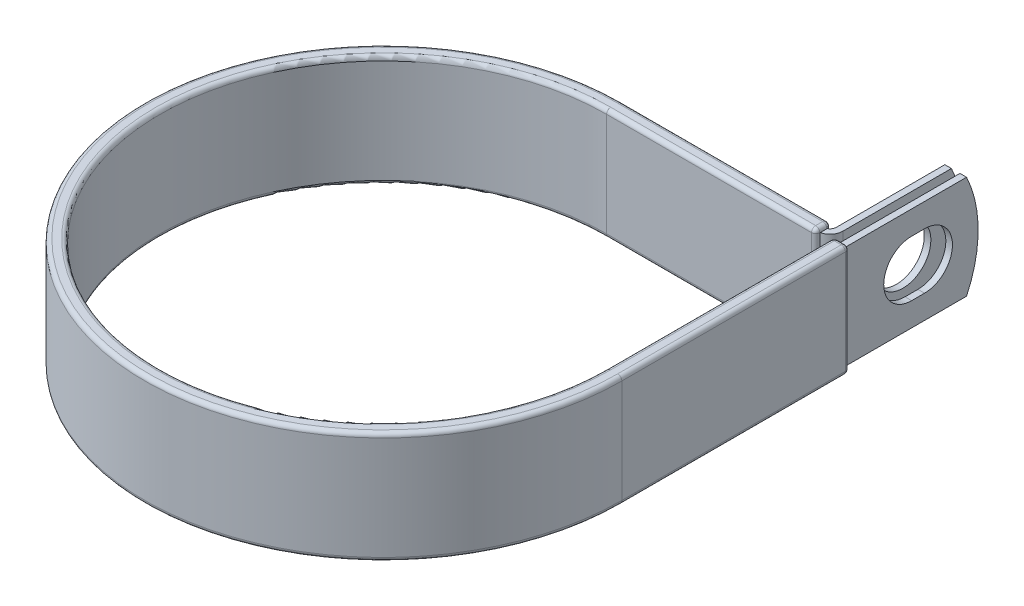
ISO-10303-21;
HEADER;
FILE_DESCRIPTION(('STEP AP214'),'2;1');
FILE_NAME('part.step','',(''),(''),'','','');
FILE_SCHEMA(('AUTOMOTIVE_DESIGN { 1 0 10303 214 1 1 1 1 }'));
ENDSEC;
DATA;
#1=APPLICATION_CONTEXT('core data for automotive mechanical design processes');
#2=APPLICATION_PROTOCOL_DEFINITION('international standard','automotive_design',2000,#1);
#3=PRODUCT_CONTEXT('',#1,'mechanical');
#4=PRODUCT('Part','Part','',(#3));
#5=PRODUCT_RELATED_PRODUCT_CATEGORY('part','',(#4));
#6=PRODUCT_DEFINITION_FORMATION('','',#4);
#7=PRODUCT_DEFINITION_CONTEXT('part definition',#1,'design');
#8=PRODUCT_DEFINITION('design','',#6,#7);
#9=PRODUCT_DEFINITION_SHAPE('','',#8);
#10=(LENGTH_UNIT() NAMED_UNIT(*) SI_UNIT(.MILLI.,.METRE.));
#11=(NAMED_UNIT(*) PLANE_ANGLE_UNIT() SI_UNIT($,.RADIAN.));
#12=(NAMED_UNIT(*) SI_UNIT($,.STERADIAN.) SOLID_ANGLE_UNIT());
#13=UNCERTAINTY_MEASURE_WITH_UNIT(LENGTH_MEASURE(1.E-05),#10,'distance_accuracy_value','');
#14=(GEOMETRIC_REPRESENTATION_CONTEXT(3) GLOBAL_UNCERTAINTY_ASSIGNED_CONTEXT((#13)) GLOBAL_UNIT_ASSIGNED_CONTEXT((#10,
#11,#12)) REPRESENTATION_CONTEXT('',''));
#15=CARTESIAN_POINT('',(0.,0.,0.));
#16=DIRECTION('',(0.,0.,1.));
#17=DIRECTION('',(1.,0.,0.));
#18=AXIS2_PLACEMENT_3D('',#15,#16,#17);
#19=CARTESIAN_POINT('',(40.49395,9.525,-66.6496));
#20=DIRECTION('',(1.,0.,0.));
#21=DIRECTION('',(0.,0.,-1.));
#22=AXIS2_PLACEMENT_3D('',#19,#20,#21);
#23=PLANE('',#22);
#24=CARTESIAN_POINT('',(40.49395,0.,-55.5498));
#25=DIRECTION('',(1.,0.,0.));
#26=DIRECTION('',(0.,0.,-1.));
#27=AXIS2_PLACEMENT_3D('',#24,#25,#26);
#28=CIRCLE('',#27,5.1562);
#29=CARTESIAN_POINT('',(40.49395,0.,-60.706));
#30=VERTEX_POINT('',#29);
#31=EDGE_CURVE('E460',#30,#30,#28,.F.);
#32=ORIENTED_EDGE('',*,*,#31,.T.);
#33=EDGE_LOOP('',(#32));
#34=FACE_BOUND('',#33,.T.);
#35=DIRECTION('',(0.,0.,1.));
#36=VECTOR('',#35,1.);
#37=CARTESIAN_POINT('',(40.49395,-9.525,-66.6496));
#38=LINE('',#37,#36);
#39=CARTESIAN_POINT('',(40.49395,-9.525,-64.5050631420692));
#40=VERTEX_POINT('',#39);
#41=CARTESIAN_POINT('',(40.49395,-9.525,-44.44619));
#42=VERTEX_POINT('',#41);
#43=EDGE_CURVE('E482',#40,#42,#38,.T.);
#44=ORIENTED_EDGE('',*,*,#43,.F.);
#45=CARTESIAN_POINT('',(40.49395,0.,-44.4246));
#46=DIRECTION('',(1.,0.,0.));
#47=DIRECTION('',(0.,0.,-1.));
#48=AXIS2_PLACEMENT_3D('',#45,#46,#47);
#49=CIRCLE('',#48,22.225);
#50=CARTESIAN_POINT('',(40.49395,9.525,-64.5050631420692));
#51=VERTEX_POINT('',#50);
#52=EDGE_CURVE('E419',#40,#51,#49,.T.);
#53=ORIENTED_EDGE('',*,*,#52,.T.);
#54=DIRECTION('',(0.,0.,1.));
#55=VECTOR('',#54,1.);
#56=CARTESIAN_POINT('',(40.49395,9.525,-66.6496));
#57=LINE('',#56,#55);
#58=CARTESIAN_POINT('',(40.49395,9.525,-44.44619));
#59=VERTEX_POINT('',#58);
#60=EDGE_CURVE('E472',#51,#59,#57,.T.);
#61=ORIENTED_EDGE('',*,*,#60,.T.);
#62=DIRECTION('',(0.,-1.,0.));
#63=VECTOR('',#62,1.);
#64=CARTESIAN_POINT('',(40.49395,9.525,-44.44619));
#65=LINE('',#64,#63);
#66=EDGE_CURVE('E489',#59,#42,#65,.T.);
#67=ORIENTED_EDGE('',*,*,#66,.T.);
#68=EDGE_LOOP('',(#44,#53,#61,#67));
#69=FACE_BOUND('',#68,.T.);
#70=ADVANCED_FACE('F54',(#34,#69),#23,.T.);
#71=CARTESIAN_POINT('',(39.27475,9.525,-66.6496));
#72=DIRECTION('',(1.,0.,0.));
#73=DIRECTION('',(0.,0.,-1.));
#74=AXIS2_PLACEMENT_3D('',#71,#72,#73);
#75=PLANE('',#74);
#76=CARTESIAN_POINT('',(39.27475,0.,-55.5498));
#77=DIRECTION('',(-1.,0.,0.));
#78=DIRECTION('',(0.,0.,1.));
#79=AXIS2_PLACEMENT_3D('',#76,#77,#78);
#80=CIRCLE('',#79,5.1562);
#81=CARTESIAN_POINT('',(39.27475,0.,-50.3936));
#82=VERTEX_POINT('',#81);
#83=EDGE_CURVE('E457',#82,#82,#80,.T.);
#84=ORIENTED_EDGE('',*,*,#83,.F.);
#85=EDGE_LOOP('',(#84));
#86=FACE_BOUND('',#85,.T.);
#87=CARTESIAN_POINT('',(39.27475,0.,-44.4246));
#88=DIRECTION('',(-1.,0.,0.));
#89=DIRECTION('',(0.,0.,1.));
#90=AXIS2_PLACEMENT_3D('',#87,#88,#89);
#91=CIRCLE('',#90,22.225);
#92=CARTESIAN_POINT('',(39.27475,9.525,-64.5050631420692));
#93=VERTEX_POINT('',#92);
#94=CARTESIAN_POINT('',(39.27475,-9.525,-64.5050631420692));
#95=VERTEX_POINT('',#94);
#96=EDGE_CURVE('E411',#93,#95,#91,.T.);
#97=ORIENTED_EDGE('',*,*,#96,.T.);
#98=DIRECTION('',(0.,0.,1.));
#99=VECTOR('',#98,1.);
#100=CARTESIAN_POINT('',(39.27475,-9.525,-66.6496));
#101=LINE('',#100,#99);
#102=CARTESIAN_POINT('',(39.27475,-9.525,-44.44619));
#103=VERTEX_POINT('',#102);
#104=EDGE_CURVE('E484',#95,#103,#101,.T.);
#105=ORIENTED_EDGE('',*,*,#104,.T.);
#106=DIRECTION('',(0.,-1.,0.));
#107=VECTOR('',#106,1.);
#108=CARTESIAN_POINT('',(39.27475,9.525,-44.44619));
#109=LINE('',#108,#107);
#110=CARTESIAN_POINT('',(39.27475,9.525,-44.44619));
#111=VERTEX_POINT('',#110);
#112=EDGE_CURVE('E477',#111,#103,#109,.T.);
#113=ORIENTED_EDGE('',*,*,#112,.F.);
#114=DIRECTION('',(0.,0.,1.));
#115=VECTOR('',#114,1.);
#116=CARTESIAN_POINT('',(39.27475,9.525,-66.6496));
#117=LINE('',#116,#115);
#118=EDGE_CURVE('E474',#93,#111,#117,.T.);
#119=ORIENTED_EDGE('',*,*,#118,.F.);
#120=EDGE_LOOP('',(#97,#105,#113,#119));
#121=FACE_BOUND('',#120,.T.);
#122=ADVANCED_FACE('F788',(#86,#121),#75,.F.);
#123=CARTESIAN_POINT('',(0.,-9.525,0.));
#124=DIRECTION('',(0.,1.,0.));
#125=DIRECTION('',(1.,0.,0.));
#126=AXIS2_PLACEMENT_3D('',#123,#124,#125);
#127=PLANE('',#126);
#128=CARTESIAN_POINT('',(38.11651,-9.525,-44.44619));
#129=DIRECTION('',(0.,-1.,0.));
#130=DIRECTION('',(0.,0.,1.));
#131=AXIS2_PLACEMENT_3D('',#128,#129,#130);
#132=CIRCLE('',#131,2.37744);
#133=CARTESIAN_POINT('',(38.6397500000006,-9.525,-42.1270434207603));
#134=VERTEX_POINT('',#133);
#135=EDGE_CURVE('E479',#42,#134,#132,.T.);
#136=ORIENTED_EDGE('',*,*,#135,.T.);
#137=DIRECTION('',(0.,0.,-1.));
#138=VECTOR('',#137,1.);
#139=CARTESIAN_POINT('',(38.6397500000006,-9.525,-43.28795));
#140=LINE('',#139,#138);
#141=CARTESIAN_POINT('',(38.6397500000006,-9.525,-43.3197));
#142=VERTEX_POINT('',#141);
#143=EDGE_CURVE('E368',#134,#142,#140,.T.);
#144=ORIENTED_EDGE('',*,*,#143,.T.);
#145=CARTESIAN_POINT('',(37.8777500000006,-9.525,-43.3197));
#146=DIRECTION('',(0.,1.,0.));
#147=DIRECTION('',(0.,0.,1.));
#148=AXIS2_PLACEMENT_3D('',#145,#146,#147);
#149=CIRCLE('',#148,0.762);
#150=CARTESIAN_POINT('',(38.6343610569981,-9.525,-43.4101638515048));
#151=VERTEX_POINT('',#150);
#152=EDGE_CURVE('E554',#142,#151,#149,.T.);
#153=ORIENTED_EDGE('',*,*,#152,.T.);
#154=CARTESIAN_POINT('',(38.11651,-9.525,-44.44619));
#155=DIRECTION('',(0.,1.,0.));
#156=DIRECTION('',(1.,0.,0.));
#157=AXIS2_PLACEMENT_3D('',#154,#155,#156);
#158=CIRCLE('',#157,1.15824);
#159=EDGE_CURVE('E77',#103,#151,#158,.F.);
#160=ORIENTED_EDGE('',*,*,#159,.F.);
#161=ORIENTED_EDGE('',*,*,#104,.F.);
#162=DIRECTION('',(-1.,0.,0.));
#163=VECTOR('',#162,1.);
#164=CARTESIAN_POINT('',(43.28795,-9.525,-64.5050631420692));
#165=LINE('',#164,#163);
#166=EDGE_CURVE('E498',#40,#95,#165,.T.);
#167=ORIENTED_EDGE('',*,*,#166,.F.);
#168=ORIENTED_EDGE('',*,*,#43,.T.);
#169=EDGE_LOOP('',(#136,#144,#153,#160,#161,#167,#168));
#170=FACE_BOUND('',#169,.T.);
#171=ADVANCED_FACE('F794',(#170),#127,.F.);
#172=CARTESIAN_POINT('',(0.,9.525,0.));
#173=DIRECTION('',(0.,1.,0.));
#174=DIRECTION('',(1.,0.,0.));
#175=AXIS2_PLACEMENT_3D('',#172,#173,#174);
#176=PLANE('',#175);
#177=DIRECTION('',(0.,0.,-1.));
#178=VECTOR('',#177,1.);
#179=CARTESIAN_POINT('',(38.63975,9.525,5.42005866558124E-13));
#180=LINE('',#179,#178);
#181=CARTESIAN_POINT('',(38.6397500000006,9.525,-42.1270434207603));
#182=VERTEX_POINT('',#181);
#183=CARTESIAN_POINT('',(38.6397500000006,9.525,-43.3197));
#184=VERTEX_POINT('',#183);
#185=EDGE_CURVE('E405',#182,#184,#180,.T.);
#186=ORIENTED_EDGE('',*,*,#185,.F.);
#187=CARTESIAN_POINT('',(38.11651,9.525,-44.44619));
#188=DIRECTION('',(0.,-1.,0.));
#189=DIRECTION('',(0.,0.,1.));
#190=AXIS2_PLACEMENT_3D('',#187,#188,#189);
#191=CIRCLE('',#190,2.37744);
#192=EDGE_CURVE('E469',#59,#182,#191,.T.);
#193=ORIENTED_EDGE('',*,*,#192,.F.);
#194=ORIENTED_EDGE('',*,*,#60,.F.);
#195=DIRECTION('',(-1.,0.,0.));
#196=VECTOR('',#195,1.);
#197=CARTESIAN_POINT('',(43.28795,9.525,-64.5050631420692));
#198=LINE('',#197,#196);
#199=EDGE_CURVE('E495',#51,#93,#198,.T.);
#200=ORIENTED_EDGE('',*,*,#199,.T.);
#201=ORIENTED_EDGE('',*,*,#118,.T.);
#202=CARTESIAN_POINT('',(38.11651,9.525,-44.44619));
#203=DIRECTION('',(0.,1.,0.));
#204=DIRECTION('',(1.,0.,0.));
#205=AXIS2_PLACEMENT_3D('',#202,#203,#204);
#206=CIRCLE('',#205,1.15824);
#207=CARTESIAN_POINT('',(38.6343610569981,9.525,-43.4101638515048));
#208=VERTEX_POINT('',#207);
#209=EDGE_CURVE('E70',#111,#208,#206,.F.);
#210=ORIENTED_EDGE('',*,*,#209,.T.);
#211=CARTESIAN_POINT('',(37.8777500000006,9.525,-43.3197));
#212=DIRECTION('',(0.,1.,0.));
#213=DIRECTION('',(0.,0.,1.));
#214=AXIS2_PLACEMENT_3D('',#211,#212,#213);
#215=CIRCLE('',#214,0.762);
#216=EDGE_CURVE('E12',#208,#184,#215,.F.);
#217=ORIENTED_EDGE('',*,*,#216,.T.);
#218=EDGE_LOOP('',(#186,#193,#194,#200,#201,#210,#217));
#219=FACE_BOUND('',#218,.T.);
#220=ADVANCED_FACE('F802',(#219),#176,.T.);
#221=CARTESIAN_POINT('',(38.11651,9.525,-44.44619));
#222=DIRECTION('',(0.,-1.,0.));
#223=DIRECTION('',(0.,0.,-1.));
#224=AXIS2_PLACEMENT_3D('',#221,#222,#223);
#225=CYLINDRICAL_SURFACE('',#224,2.37744);
#226=ORIENTED_EDGE('',*,*,#135,.F.);
#227=ORIENTED_EDGE('',*,*,#66,.F.);
#228=ORIENTED_EDGE('',*,*,#192,.T.);
#229=CARTESIAN_POINT('',(38.11651,9.525,-44.44619));
#230=DIRECTION('',(0.,-1.,0.));
#231=DIRECTION('',(0.,0.,-1.));
#232=AXIS2_PLACEMENT_3D('',#229,#230,#231);
#233=CIRCLE('',#232,2.37744);
#234=CARTESIAN_POINT('',(38.11651,9.525,-42.06875));
#235=VERTEX_POINT('',#234);
#236=EDGE_CURVE('E402',#235,#182,#233,.F.);
#237=ORIENTED_EDGE('',*,*,#236,.F.);
#238=DIRECTION('',(0.,-1.,0.));
#239=VECTOR('',#238,1.);
#240=CARTESIAN_POINT('',(38.11651,9.525,-42.06875));
#241=LINE('',#240,#239);
#242=CARTESIAN_POINT('',(38.11651,-9.52500000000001,-42.06875));
#243=VERTEX_POINT('',#242);
#244=EDGE_CURVE('E492',#235,#243,#241,.T.);
#245=ORIENTED_EDGE('',*,*,#244,.T.);
#246=CARTESIAN_POINT('',(38.11651,-9.52500000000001,-44.44619));
#247=DIRECTION('',(0.,1.,0.));
#248=DIRECTION('',(-1.,0.,0.));
#249=AXIS2_PLACEMENT_3D('',#246,#247,#248);
#250=CIRCLE('',#249,2.37744);
#251=EDGE_CURVE('E400',#134,#243,#250,.F.);
#252=ORIENTED_EDGE('',*,*,#251,.F.);
#253=EDGE_LOOP('',(#226,#227,#228,#237,#245,#252));
#254=FACE_BOUND('',#253,.T.);
#255=ADVANCED_FACE('F799',(#254),#225,.T.);
#256=CARTESIAN_POINT('',(38.11651,9.525,-44.44619));
#257=DIRECTION('',(0.,-1.,0.));
#258=DIRECTION('',(0.,0.,-1.));
#259=AXIS2_PLACEMENT_3D('',#256,#257,#258);
#260=CYLINDRICAL_SURFACE('',#259,1.15824);
#261=ORIENTED_EDGE('',*,*,#159,.T.);
#262=DIRECTION('',(0.,1.,0.));
#263=VECTOR('',#262,1.);
#264=CARTESIAN_POINT('',(38.6343610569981,-9.525,-43.4101638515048));
#265=LINE('',#264,#263);
#266=EDGE_CURVE('E63',#151,#208,#265,.T.);
#267=ORIENTED_EDGE('',*,*,#266,.T.);
#268=ORIENTED_EDGE('',*,*,#209,.F.);
#269=ORIENTED_EDGE('',*,*,#112,.T.);
#270=EDGE_LOOP('',(#261,#267,#268,#269));
#271=FACE_BOUND('',#270,.T.);
#272=ADVANCED_FACE('F801',(#271),#260,.F.);
#273=CARTESIAN_POINT('',(55.0778859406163,0.,-55.5498));
#274=DIRECTION('',(-1.,0.,0.));
#275=DIRECTION('',(0.,0.,1.));
#276=AXIS2_PLACEMENT_3D('',#273,#274,#275);
#277=CYLINDRICAL_SURFACE('',#276,5.1562);
#278=ORIENTED_EDGE('',*,*,#83,.T.);
#279=EDGE_LOOP('',(#278));
#280=FACE_BOUND('',#279,.T.);
#281=ORIENTED_EDGE('',*,*,#31,.F.);
#282=EDGE_LOOP('',(#281));
#283=FACE_BOUND('',#282,.T.);
#284=ADVANCED_FACE('F808',(#280,#283),#277,.F.);
#285=CARTESIAN_POINT('',(43.28795,0.,-44.4246));
#286=DIRECTION('',(-1.,0.,0.));
#287=DIRECTION('',(0.,0.,1.));
#288=AXIS2_PLACEMENT_3D('',#285,#286,#287);
#289=CYLINDRICAL_SURFACE('',#288,22.225);
#290=ORIENTED_EDGE('',*,*,#52,.F.);
#291=ORIENTED_EDGE('',*,*,#166,.T.);
#292=ORIENTED_EDGE('',*,*,#96,.F.);
#293=ORIENTED_EDGE('',*,*,#199,.F.);
#294=EDGE_LOOP('',(#290,#291,#292,#293));
#295=FACE_BOUND('',#294,.T.);
#296=ADVANCED_FACE('F859',(#295),#289,.T.);
#297=CARTESIAN_POINT('',(5.9010499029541E-13,-9.525,-42.06875));
#298=DIRECTION('',(0.,0.,1.));
#299=DIRECTION('',(1.,0.,0.));
#300=AXIS2_PLACEMENT_3D('',#297,#298,#299);
#301=PLANE('',#300);
#302=DIRECTION('',(1.,0.,0.));
#303=VECTOR('',#302,1.);
#304=CARTESIAN_POINT('',(5.9010499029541E-13,-9.525,-42.06875));
#305=LINE('',#304,#303);
#306=CARTESIAN_POINT('',(38.6397500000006,-9.525,-42.06875));
#307=VERTEX_POINT('',#306);
#308=EDGE_CURVE('E375',#243,#307,#305,.T.);
#309=ORIENTED_EDGE('',*,*,#308,.F.);
#310=ORIENTED_EDGE('',*,*,#244,.F.);
#311=DIRECTION('',(1.,0.,0.));
#312=VECTOR('',#311,1.);
#313=CARTESIAN_POINT('',(5.9010499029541E-13,9.525,-42.06875));
#314=LINE('',#313,#312);
#315=CARTESIAN_POINT('',(38.6397500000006,9.525,-42.06875));
#316=VERTEX_POINT('',#315);
#317=EDGE_CURVE('E377',#235,#316,#314,.T.);
#318=ORIENTED_EDGE('',*,*,#317,.T.);
#319=DIRECTION('',(0.,-1.,0.));
#320=VECTOR('',#319,1.);
#321=CARTESIAN_POINT('',(38.6397500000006,-9.525,-42.06875));
#322=LINE('',#321,#320);
#323=EDGE_CURVE('E307',#316,#307,#322,.T.);
#324=ORIENTED_EDGE('',*,*,#323,.T.);
#325=EDGE_LOOP('',(#309,#310,#318,#324));
#326=FACE_BOUND('',#325,.T.);
#327=ADVANCED_FACE('F831',(#326),#301,.F.);
#328=CARTESIAN_POINT('',(38.6397500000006,-9.55675,-42.037));
#329=DIRECTION('',(1.,0.,0.));
#330=DIRECTION('',(0.,0.,-1.));
#331=AXIS2_PLACEMENT_3D('',#328,#329,#330);
#332=PLANE('',#331);
#333=DIRECTION('',(0.,0.,-1.));
#334=VECTOR('',#333,1.);
#335=CARTESIAN_POINT('',(38.6397500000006,-9.55675,-43.3197));
#336=LINE('',#335,#334);
#337=CARTESIAN_POINT('',(38.6397500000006,-9.55675,-42.037));
#338=VERTEX_POINT('',#337);
#339=CARTESIAN_POINT('',(38.6397500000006,-9.55675,-43.3197));
#340=VERTEX_POINT('',#339);
#341=EDGE_CURVE('E508',#338,#340,#336,.T.);
#342=ORIENTED_EDGE('',*,*,#341,.T.);
#343=DIRECTION('',(0.,1.,0.));
#344=VECTOR('',#343,1.);
#345=CARTESIAN_POINT('',(38.6397500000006,-9.55675,-43.3197));
#346=LINE('',#345,#344);
#347=EDGE_CURVE('E512',#340,#142,#346,.T.);
#348=ORIENTED_EDGE('',*,*,#347,.T.);
#349=ORIENTED_EDGE('',*,*,#143,.F.);
#350=EDGE_CURVE('E369',#307,#134,#140,.T.);
#351=ORIENTED_EDGE('',*,*,#350,.F.);
#352=ORIENTED_EDGE('',*,*,#323,.F.);
#353=DIRECTION('',(0.,0.,1.));
#354=VECTOR('',#353,1.);
#355=CARTESIAN_POINT('',(38.6397500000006,9.525,-42.06875));
#356=LINE('',#355,#354);
#357=EDGE_CURVE('E372',#182,#316,#356,.T.);
#358=ORIENTED_EDGE('',*,*,#357,.F.);
#359=ORIENTED_EDGE('',*,*,#185,.T.);
#360=DIRECTION('',(0.,1.,0.));
#361=VECTOR('',#360,1.);
#362=CARTESIAN_POINT('',(38.6397500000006,-9.55675,-43.3197));
#363=LINE('',#362,#361);
#364=CARTESIAN_POINT('',(38.6397500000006,9.55674999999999,-43.3197));
#365=VERTEX_POINT('',#364);
#366=EDGE_CURVE('E510',#184,#365,#363,.T.);
#367=ORIENTED_EDGE('',*,*,#366,.T.);
#368=DIRECTION('',(0.,0.,1.));
#369=VECTOR('',#368,1.);
#370=CARTESIAN_POINT('',(38.6397500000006,9.55674999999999,-42.037));
#371=LINE('',#370,#369);
#372=CARTESIAN_POINT('',(38.6397500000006,9.55674999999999,-42.037));
#373=VERTEX_POINT('',#372);
#374=EDGE_CURVE('E504',#365,#373,#371,.T.);
#375=ORIENTED_EDGE('',*,*,#374,.T.);
#376=DIRECTION('',(0.,-1.,0.));
#377=VECTOR('',#376,1.);
#378=CARTESIAN_POINT('',(38.6397500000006,-9.55675,-42.037));
#379=LINE('',#378,#377);
#380=EDGE_CURVE('E506',#373,#338,#379,.T.);
#381=ORIENTED_EDGE('',*,*,#380,.T.);
#382=EDGE_LOOP('',(#342,#348,#349,#351,#352,#358,#359,#367,#375,#381));
#383=FACE_BOUND('',#382,.T.);
#384=ADVANCED_FACE('F827',(#383),#332,.T.);
#385=CARTESIAN_POINT('',(6.07652263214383E-13,-9.55675,-43.3197));
#386=DIRECTION('',(1.,0.,0.));
#387=DIRECTION('',(0.,0.,-1.));
#388=AXIS2_PLACEMENT_3D('',#385,#386,#387);
#389=CYLINDRICAL_SURFACE('',#388,0.762000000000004);
#390=DIRECTION('',(1.,0.,0.));
#391=VECTOR('',#390,1.);
#392=CARTESIAN_POINT('',(6.18340957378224E-13,-9.55675,-44.0817));
#393=LINE('',#392,#391);
#394=CARTESIAN_POINT('',(6.18340957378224E-13,-9.55675,-44.0817));
#395=VERTEX_POINT('',#394);
#396=CARTESIAN_POINT('',(37.8777500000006,-9.55675,-44.0817));
#397=VERTEX_POINT('',#396);
#398=EDGE_CURVE('E394',#395,#397,#393,.T.);
#399=ORIENTED_EDGE('',*,*,#398,.T.);
#400=CARTESIAN_POINT('',(37.8777500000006,-9.55675,-43.3197));
#401=DIRECTION('',(1.,0.,0.));
#402=DIRECTION('',(0.,0.,-1.));
#403=AXIS2_PLACEMENT_3D('',#400,#401,#402);
#404=CIRCLE('',#403,0.762000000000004);
#405=CARTESIAN_POINT('',(37.8777500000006,-10.31875,-43.3197));
#406=VERTEX_POINT('',#405);
#407=EDGE_CURVE('E517',#397,#406,#404,.F.);
#408=ORIENTED_EDGE('',*,*,#407,.T.);
#409=DIRECTION('',(1.,0.,0.));
#410=VECTOR('',#409,1.);
#411=CARTESIAN_POINT('',(6.07652263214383E-13,-10.31875,-43.3197));
#412=LINE('',#411,#410);
#413=CARTESIAN_POINT('',(6.07652263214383E-13,-10.31875,-43.3197));
#414=VERTEX_POINT('',#413);
#415=EDGE_CURVE('E397',#414,#406,#412,.T.);
#416=ORIENTED_EDGE('',*,*,#415,.F.);
#417=CARTESIAN_POINT('',(6.07652263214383E-13,-9.55675,-43.3197));
#418=DIRECTION('',(1.,0.,0.));
#419=DIRECTION('',(0.,0.,1.));
#420=AXIS2_PLACEMENT_3D('',#417,#418,#419);
#421=CIRCLE('',#420,0.762000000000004);
#422=EDGE_CURVE('E345',#414,#395,#421,.T.);
#423=ORIENTED_EDGE('',*,*,#422,.T.);
#424=EDGE_LOOP('',(#399,#408,#416,#423));
#425=FACE_BOUND('',#424,.T.);
#426=ADVANCED_FACE('F670',(#425),#389,.T.);
#427=CARTESIAN_POINT('',(6.18340957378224E-13,9.55675,-44.0817));
#428=DIRECTION('',(0.,0.,-1.));
#429=DIRECTION('',(0.,1.,0.));
#430=AXIS2_PLACEMENT_3D('',#427,#428,#429);
#431=PLANE('',#430);
#432=DIRECTION('',(1.,0.,0.));
#433=VECTOR('',#432,1.);
#434=CARTESIAN_POINT('',(6.18340957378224E-13,9.55675,-44.0817));
#435=LINE('',#434,#433);
#436=CARTESIAN_POINT('',(6.18340957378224E-13,9.55675,-44.0817));
#437=VERTEX_POINT('',#436);
#438=CARTESIAN_POINT('',(37.8777500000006,9.55675,-44.0817));
#439=VERTEX_POINT('',#438);
#440=EDGE_CURVE('E391',#437,#439,#435,.T.);
#441=ORIENTED_EDGE('',*,*,#440,.T.);
#442=DIRECTION('',(0.,1.,0.));
#443=VECTOR('',#442,1.);
#444=CARTESIAN_POINT('',(37.8777500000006,9.55675,-44.0817));
#445=LINE('',#444,#443);
#446=EDGE_CURVE('E515',#439,#397,#445,.F.);
#447=ORIENTED_EDGE('',*,*,#446,.T.);
#448=ORIENTED_EDGE('',*,*,#398,.F.);
#449=DIRECTION('',(0.,1.,0.));
#450=VECTOR('',#449,1.);
#451=CARTESIAN_POINT('',(6.18340957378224E-13,9.55675,-44.0817));
#452=LINE('',#451,#450);
#453=EDGE_CURVE('E342',#395,#437,#452,.T.);
#454=ORIENTED_EDGE('',*,*,#453,.T.);
#455=EDGE_LOOP('',(#441,#447,#448,#454));
#456=FACE_BOUND('',#455,.T.);
#457=ADVANCED_FACE('F676',(#456),#431,.T.);
#458=CARTESIAN_POINT('',(6.07652263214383E-13,9.55675,-43.3197));
#459=DIRECTION('',(1.,0.,0.));
#460=DIRECTION('',(0.,0.,-1.));
#461=AXIS2_PLACEMENT_3D('',#458,#459,#460);
#462=CYLINDRICAL_SURFACE('',#461,0.762000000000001);
#463=DIRECTION('',(1.,0.,0.));
#464=VECTOR('',#463,1.);
#465=CARTESIAN_POINT('',(6.07652263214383E-13,10.31875,-43.3197));
#466=LINE('',#465,#464);
#467=CARTESIAN_POINT('',(6.07652263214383E-13,10.31875,-43.3197));
#468=VERTEX_POINT('',#467);
#469=CARTESIAN_POINT('',(37.8777500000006,10.31875,-43.3197));
#470=VERTEX_POINT('',#469);
#471=EDGE_CURVE('E388',#468,#470,#466,.T.);
#472=ORIENTED_EDGE('',*,*,#471,.T.);
#473=CARTESIAN_POINT('',(37.8777500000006,9.55675,-43.3197));
#474=DIRECTION('',(1.,0.,0.));
#475=DIRECTION('',(0.,0.,-1.));
#476=AXIS2_PLACEMENT_3D('',#473,#474,#475);
#477=CIRCLE('',#476,0.762000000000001);
#478=EDGE_CURVE('E501',#470,#439,#477,.F.);
#479=ORIENTED_EDGE('',*,*,#478,.T.);
#480=ORIENTED_EDGE('',*,*,#440,.F.);
#481=CARTESIAN_POINT('',(6.07652263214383E-13,9.55675,-43.3197));
#482=DIRECTION('',(1.,0.,0.));
#483=DIRECTION('',(0.,0.,1.));
#484=AXIS2_PLACEMENT_3D('',#481,#482,#483);
#485=CIRCLE('',#484,0.762000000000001);
#486=EDGE_CURVE('E339',#437,#468,#485,.T.);
#487=ORIENTED_EDGE('',*,*,#486,.T.);
#488=EDGE_LOOP('',(#472,#479,#480,#487));
#489=FACE_BOUND('',#488,.T.);
#490=ADVANCED_FACE('F680',(#489),#462,.T.);
#491=CARTESIAN_POINT('',(5.89659628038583E-13,9.55675,-42.037));
#492=DIRECTION('',(1.,0.,0.));
#493=DIRECTION('',(0.,0.,-1.));
#494=AXIS2_PLACEMENT_3D('',#491,#492,#493);
#495=CYLINDRICAL_SURFACE('',#494,0.762);
#496=DIRECTION('',(1.,0.,0.));
#497=VECTOR('',#496,1.);
#498=CARTESIAN_POINT('',(5.78970933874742E-13,9.55675,-41.275));
#499=LINE('',#498,#497);
#500=CARTESIAN_POINT('',(5.78970933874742E-13,9.55675,-41.275));
#501=VERTEX_POINT('',#500);
#502=CARTESIAN_POINT('',(37.8777500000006,9.55675,-41.275));
#503=VERTEX_POINT('',#502);
#504=EDGE_CURVE('E382',#501,#503,#499,.T.);
#505=ORIENTED_EDGE('',*,*,#504,.T.);
#506=CARTESIAN_POINT('',(37.8777500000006,9.55675,-42.037));
#507=DIRECTION('',(1.,0.,0.));
#508=DIRECTION('',(0.,0.,-1.));
#509=AXIS2_PLACEMENT_3D('',#506,#507,#508);
#510=CIRCLE('',#509,0.762);
#511=CARTESIAN_POINT('',(37.8777500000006,10.31875,-42.037));
#512=VERTEX_POINT('',#511);
#513=EDGE_CURVE('E527',#503,#512,#510,.F.);
#514=ORIENTED_EDGE('',*,*,#513,.T.);
#515=DIRECTION('',(1.,0.,0.));
#516=VECTOR('',#515,1.);
#517=CARTESIAN_POINT('',(5.89659628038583E-13,10.31875,-42.037));
#518=LINE('',#517,#516);
#519=CARTESIAN_POINT('',(5.89659628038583E-13,10.31875,-42.037));
#520=VERTEX_POINT('',#519);
#521=EDGE_CURVE('E385',#520,#512,#518,.T.);
#522=ORIENTED_EDGE('',*,*,#521,.F.);
#523=CARTESIAN_POINT('',(5.89659628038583E-13,9.55675,-42.037));
#524=DIRECTION('',(1.,0.,0.));
#525=DIRECTION('',(0.,0.,1.));
#526=AXIS2_PLACEMENT_3D('',#523,#524,#525);
#527=CIRCLE('',#526,0.762);
#528=EDGE_CURVE('E336',#520,#501,#527,.T.);
#529=ORIENTED_EDGE('',*,*,#528,.T.);
#530=EDGE_LOOP('',(#505,#514,#522,#529));
#531=FACE_BOUND('',#530,.T.);
#532=ADVANCED_FACE('F721',(#531),#495,.T.);
#533=CARTESIAN_POINT('',(5.78970933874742E-13,-9.55675,-41.275));
#534=DIRECTION('',(0.,0.,1.));
#535=DIRECTION('',(0.,-1.,0.));
#536=AXIS2_PLACEMENT_3D('',#533,#534,#535);
#537=PLANE('',#536);
#538=DIRECTION('',(1.,0.,0.));
#539=VECTOR('',#538,1.);
#540=CARTESIAN_POINT('',(5.78970933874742E-13,-9.55675,-41.275));
#541=LINE('',#540,#539);
#542=CARTESIAN_POINT('',(5.78970933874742E-13,-9.55675,-41.275));
#543=VERTEX_POINT('',#542);
#544=CARTESIAN_POINT('',(37.8777500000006,-9.55675,-41.275));
#545=VERTEX_POINT('',#544);
#546=EDGE_CURVE('E379',#543,#545,#541,.T.);
#547=ORIENTED_EDGE('',*,*,#546,.T.);
#548=DIRECTION('',(0.,-1.,0.));
#549=VECTOR('',#548,1.);
#550=CARTESIAN_POINT('',(37.8777500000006,-9.55675,-41.275));
#551=LINE('',#550,#549);
#552=EDGE_CURVE('E525',#545,#503,#551,.F.);
#553=ORIENTED_EDGE('',*,*,#552,.T.);
#554=ORIENTED_EDGE('',*,*,#504,.F.);
#555=DIRECTION('',(0.,-1.,0.));
#556=VECTOR('',#555,1.);
#557=CARTESIAN_POINT('',(5.78970933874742E-13,-9.55675,-41.275));
#558=LINE('',#557,#556);
#559=EDGE_CURVE('E327',#501,#543,#558,.T.);
#560=ORIENTED_EDGE('',*,*,#559,.T.);
#561=EDGE_LOOP('',(#547,#553,#554,#560));
#562=FACE_BOUND('',#561,.T.);
#563=ADVANCED_FACE('F719',(#562),#537,.T.);
#564=CARTESIAN_POINT('',(5.89659628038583E-13,-9.55675,-42.037));
#565=DIRECTION('',(1.,0.,0.));
#566=DIRECTION('',(0.,0.,-1.));
#567=AXIS2_PLACEMENT_3D('',#564,#565,#566);
#568=CYLINDRICAL_SURFACE('',#567,0.762000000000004);
#569=DIRECTION('',(1.,0.,0.));
#570=VECTOR('',#569,1.);
#571=CARTESIAN_POINT('',(5.89659628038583E-13,-10.31875,-42.037));
#572=LINE('',#571,#570);
#573=CARTESIAN_POINT('',(5.89659628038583E-13,-10.31875,-42.037));
#574=VERTEX_POINT('',#573);
#575=CARTESIAN_POINT('',(37.8777500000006,-10.31875,-42.037));
#576=VERTEX_POINT('',#575);
#577=EDGE_CURVE('E303',#574,#576,#572,.T.);
#578=ORIENTED_EDGE('',*,*,#577,.T.);
#579=CARTESIAN_POINT('',(37.8777500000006,-9.55675,-42.037));
#580=DIRECTION('',(1.,0.,0.));
#581=DIRECTION('',(0.,0.,-1.));
#582=AXIS2_PLACEMENT_3D('',#579,#580,#581);
#583=CIRCLE('',#582,0.762000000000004);
#584=EDGE_CURVE('E523',#576,#545,#583,.F.);
#585=ORIENTED_EDGE('',*,*,#584,.T.);
#586=ORIENTED_EDGE('',*,*,#546,.F.);
#587=CARTESIAN_POINT('',(5.89659628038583E-13,-9.55675,-42.037));
#588=DIRECTION('',(1.,0.,0.));
#589=DIRECTION('',(0.,0.,-1.));
#590=AXIS2_PLACEMENT_3D('',#587,#588,#589);
#591=CIRCLE('',#590,0.762000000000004);
#592=EDGE_CURVE('E324',#543,#574,#591,.T.);
#593=ORIENTED_EDGE('',*,*,#592,.T.);
#594=EDGE_LOOP('',(#578,#585,#586,#593));
#595=FACE_BOUND('',#594,.T.);
#596=ADVANCED_FACE('F709',(#595),#568,.T.);
#597=CARTESIAN_POINT('',(0.,-9.55675,0.));
#598=DIRECTION('',(0.,-1.,0.));
#599=DIRECTION('',(0.,0.,-1.));
#600=AXIS2_PLACEMENT_3D('',#597,#598,#599);
#601=TOROIDAL_SURFACE('',#600,43.3197,0.762000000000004);
#602=CARTESIAN_POINT('',(43.3197,-9.55675,0.));
#603=DIRECTION('',(0.,0.,1.));
#604=DIRECTION('',(-1.,0.,0.));
#605=AXIS2_PLACEMENT_3D('',#602,#603,#604);
#606=CIRCLE('',#605,0.762000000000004);
#607=CARTESIAN_POINT('',(43.3197,-10.31875,0.));
#608=VERTEX_POINT('',#607);
#609=CARTESIAN_POINT('',(44.0817,-9.55675,0.));
#610=VERTEX_POINT('',#609);
#611=EDGE_CURVE('E318',#608,#610,#606,.T.);
#612=ORIENTED_EDGE('',*,*,#611,.T.);
#613=CARTESIAN_POINT('',(0.,-9.55675,0.));
#614=DIRECTION('',(0.,-1.,0.));
#615=DIRECTION('',(0.,0.,-1.));
#616=AXIS2_PLACEMENT_3D('',#613,#614,#615);
#617=CIRCLE('',#616,44.0817);
#618=EDGE_CURVE('E361',#610,#395,#617,.T.);
#619=ORIENTED_EDGE('',*,*,#618,.T.);
#620=ORIENTED_EDGE('',*,*,#422,.F.);
#621=CARTESIAN_POINT('',(0.,-10.31875,0.));
#622=DIRECTION('',(0.,-1.,0.));
#623=DIRECTION('',(0.,0.,-1.));
#624=AXIS2_PLACEMENT_3D('',#621,#622,#623);
#625=CIRCLE('',#624,43.3197);
#626=EDGE_CURVE('E308',#608,#414,#625,.T.);
#627=ORIENTED_EDGE('',*,*,#626,.F.);
#628=EDGE_LOOP('',(#612,#619,#620,#627));
#629=FACE_BOUND('',#628,.T.);
#630=ADVANCED_FACE('F667',(#629),#601,.T.);
#631=CARTESIAN_POINT('',(0.,9.525,0.));
#632=DIRECTION('',(0.,-1.,0.));
#633=DIRECTION('',(0.,0.,-1.));
#634=AXIS2_PLACEMENT_3D('',#631,#632,#633);
#635=CYLINDRICAL_SURFACE('',#634,44.0817);
#636=DIRECTION('',(0.,1.,0.));
#637=VECTOR('',#636,1.);
#638=CARTESIAN_POINT('',(44.0817,9.55675,0.));
#639=LINE('',#638,#637);
#640=CARTESIAN_POINT('',(44.0817,9.55675,0.));
#641=VERTEX_POINT('',#640);
#642=EDGE_CURVE('E655',#610,#641,#639,.T.);
#643=ORIENTED_EDGE('',*,*,#642,.T.);
#644=CARTESIAN_POINT('',(0.,9.55675,0.));
#645=DIRECTION('',(0.,-1.,0.));
#646=DIRECTION('',(0.,0.,-1.));
#647=AXIS2_PLACEMENT_3D('',#644,#645,#646);
#648=CIRCLE('',#647,44.0817);
#649=EDGE_CURVE('E358',#641,#437,#648,.T.);
#650=ORIENTED_EDGE('',*,*,#649,.T.);
#651=ORIENTED_EDGE('',*,*,#453,.F.);
#652=ORIENTED_EDGE('',*,*,#618,.F.);
#653=EDGE_LOOP('',(#643,#650,#651,#652));
#654=FACE_BOUND('',#653,.T.);
#655=ADVANCED_FACE('F673',(#654),#635,.T.);
#656=CARTESIAN_POINT('',(0.,9.55675,0.));
#657=DIRECTION('',(0.,-1.,0.));
#658=DIRECTION('',(0.,0.,-1.));
#659=AXIS2_PLACEMENT_3D('',#656,#657,#658);
#660=TOROIDAL_SURFACE('',#659,43.3197,0.762000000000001);
#661=CARTESIAN_POINT('',(43.3197,9.55675,0.));
#662=DIRECTION('',(0.,0.,1.));
#663=DIRECTION('',(-1.,0.,0.));
#664=AXIS2_PLACEMENT_3D('',#661,#662,#663);
#665=CIRCLE('',#664,0.762000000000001);
#666=CARTESIAN_POINT('',(43.3197,10.31875,0.));
#667=VERTEX_POINT('',#666);
#668=EDGE_CURVE('E734',#641,#667,#665,.T.);
#669=ORIENTED_EDGE('',*,*,#668,.T.);
#670=CARTESIAN_POINT('',(0.,10.31875,0.));
#671=DIRECTION('',(0.,-1.,0.));
#672=DIRECTION('',(0.,0.,-1.));
#673=AXIS2_PLACEMENT_3D('',#670,#671,#672);
#674=CIRCLE('',#673,43.3197);
#675=EDGE_CURVE('E355',#667,#468,#674,.T.);
#676=ORIENTED_EDGE('',*,*,#675,.T.);
#677=ORIENTED_EDGE('',*,*,#486,.F.);
#678=ORIENTED_EDGE('',*,*,#649,.F.);
#679=EDGE_LOOP('',(#669,#676,#677,#678));
#680=FACE_BOUND('',#679,.T.);
#681=ADVANCED_FACE('F678',(#680),#660,.T.);
#682=CARTESIAN_POINT('',(0.,9.55675,0.));
#683=DIRECTION('',(0.,-1.,0.));
#684=DIRECTION('',(0.,0.,-1.));
#685=AXIS2_PLACEMENT_3D('',#682,#683,#684);
#686=TOROIDAL_SURFACE('',#685,42.037,0.762);
#687=CARTESIAN_POINT('',(42.037,9.55675,0.));
#688=DIRECTION('',(0.,0.,1.));
#689=DIRECTION('',(-1.,0.,0.));
#690=AXIS2_PLACEMENT_3D('',#687,#688,#689);
#691=CIRCLE('',#690,0.762);
#692=CARTESIAN_POINT('',(42.037,10.31875,0.));
#693=VERTEX_POINT('',#692);
#694=CARTESIAN_POINT('',(41.275,9.55675,0.));
#695=VERTEX_POINT('',#694);
#696=EDGE_CURVE('E730',#693,#695,#691,.T.);
#697=ORIENTED_EDGE('',*,*,#696,.T.);
#698=CARTESIAN_POINT('',(0.,9.55675,0.));
#699=DIRECTION('',(0.,-1.,0.));
#700=DIRECTION('',(0.,0.,-1.));
#701=AXIS2_PLACEMENT_3D('',#698,#699,#700);
#702=CIRCLE('',#701,41.275);
#703=EDGE_CURVE('E349',#695,#501,#702,.T.);
#704=ORIENTED_EDGE('',*,*,#703,.T.);
#705=ORIENTED_EDGE('',*,*,#528,.F.);
#706=CARTESIAN_POINT('',(0.,10.31875,0.));
#707=DIRECTION('',(0.,-1.,0.));
#708=DIRECTION('',(0.,0.,-1.));
#709=AXIS2_PLACEMENT_3D('',#706,#707,#708);
#710=CIRCLE('',#709,42.037);
#711=EDGE_CURVE('E352',#693,#520,#710,.T.);
#712=ORIENTED_EDGE('',*,*,#711,.F.);
#713=EDGE_LOOP('',(#697,#704,#705,#712));
#714=FACE_BOUND('',#713,.T.);
#715=ADVANCED_FACE('F728',(#714),#686,.T.);
#716=CARTESIAN_POINT('',(0.,9.525,0.));
#717=DIRECTION('',(0.,-1.,0.));
#718=DIRECTION('',(0.,0.,-1.));
#719=AXIS2_PLACEMENT_3D('',#716,#717,#718);
#720=CYLINDRICAL_SURFACE('',#719,41.275);
#721=DIRECTION('',(0.,-1.,0.));
#722=VECTOR('',#721,1.);
#723=CARTESIAN_POINT('',(41.275,-9.55675,0.));
#724=LINE('',#723,#722);
#725=CARTESIAN_POINT('',(41.275,-9.55675,0.));
#726=VERTEX_POINT('',#725);
#727=EDGE_CURVE('E733',#695,#726,#724,.T.);
#728=ORIENTED_EDGE('',*,*,#727,.T.);
#729=CARTESIAN_POINT('',(0.,-9.55675,0.));
#730=DIRECTION('',(0.,-1.,0.));
#731=DIRECTION('',(0.,0.,-1.));
#732=AXIS2_PLACEMENT_3D('',#729,#730,#731);
#733=CIRCLE('',#732,41.275);
#734=EDGE_CURVE('E314',#726,#543,#733,.T.);
#735=ORIENTED_EDGE('',*,*,#734,.T.);
#736=ORIENTED_EDGE('',*,*,#559,.F.);
#737=ORIENTED_EDGE('',*,*,#703,.F.);
#738=EDGE_LOOP('',(#728,#735,#736,#737));
#739=FACE_BOUND('',#738,.T.);
#740=ADVANCED_FACE('F726',(#739),#720,.F.);
#741=CARTESIAN_POINT('',(0.,-9.55675,0.));
#742=DIRECTION('',(0.,-1.,0.));
#743=DIRECTION('',(0.,0.,-1.));
#744=AXIS2_PLACEMENT_3D('',#741,#742,#743);
#745=TOROIDAL_SURFACE('',#744,42.037,0.762000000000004);
#746=CARTESIAN_POINT('',(42.037,-9.55675,0.));
#747=DIRECTION('',(0.,0.,1.));
#748=DIRECTION('',(1.,0.,0.));
#749=AXIS2_PLACEMENT_3D('',#746,#747,#748);
#750=CIRCLE('',#749,0.762000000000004);
#751=CARTESIAN_POINT('',(42.037,-10.31875,0.));
#752=VERTEX_POINT('',#751);
#753=EDGE_CURVE('E311',#726,#752,#750,.T.);
#754=ORIENTED_EDGE('',*,*,#753,.T.);
#755=CARTESIAN_POINT('',(0.,-10.31875,0.));
#756=DIRECTION('',(0.,-1.,0.));
#757=DIRECTION('',(0.,0.,-1.));
#758=AXIS2_PLACEMENT_3D('',#755,#756,#757);
#759=CIRCLE('',#758,42.037);
#760=EDGE_CURVE('E295',#752,#574,#759,.T.);
#761=ORIENTED_EDGE('',*,*,#760,.T.);
#762=ORIENTED_EDGE('',*,*,#592,.F.);
#763=ORIENTED_EDGE('',*,*,#734,.F.);
#764=EDGE_LOOP('',(#754,#761,#762,#763));
#765=FACE_BOUND('',#764,.T.);
#766=ADVANCED_FACE('F312',(#765),#745,.T.);
#767=CARTESIAN_POINT('',(42.037,-9.55675,0.));
#768=DIRECTION('',(0.,0.,-1.));
#769=DIRECTION('',(-1.,0.,0.));
#770=AXIS2_PLACEMENT_3D('',#767,#768,#769);
#771=CYLINDRICAL_SURFACE('',#770,0.762000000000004);
#772=DIRECTION('',(0.,0.,-1.));
#773=VECTOR('',#772,1.);
#774=CARTESIAN_POINT('',(41.275,-9.55675,0.));
#775=LINE('',#774,#773);
#776=CARTESIAN_POINT('',(41.275,-9.55675,-41.30675));
#777=VERTEX_POINT('',#776);
#778=EDGE_CURVE('E741',#726,#777,#775,.T.);
#779=ORIENTED_EDGE('',*,*,#778,.T.);
#780=CARTESIAN_POINT('',(42.037,-9.55675,-41.30675));
#781=DIRECTION('',(0.,0.,-1.));
#782=DIRECTION('',(-1.,0.,0.));
#783=AXIS2_PLACEMENT_3D('',#780,#781,#782);
#784=CIRCLE('',#783,0.762000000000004);
#785=CARTESIAN_POINT('',(42.037,-10.31875,-41.30675));
#786=VERTEX_POINT('',#785);
#787=EDGE_CURVE('E323',#777,#786,#784,.F.);
#788=ORIENTED_EDGE('',*,*,#787,.T.);
#789=DIRECTION('',(0.,0.,-1.));
#790=VECTOR('',#789,1.);
#791=CARTESIAN_POINT('',(42.037,-10.31875,0.));
#792=LINE('',#791,#790);
#793=EDGE_CURVE('E300',#752,#786,#792,.T.);
#794=ORIENTED_EDGE('',*,*,#793,.F.);
#795=ORIENTED_EDGE('',*,*,#753,.F.);
#796=EDGE_LOOP('',(#779,#788,#794,#795));
#797=FACE_BOUND('',#796,.T.);
#798=ADVANCED_FACE('F321',(#797),#771,.T.);
#799=CARTESIAN_POINT('',(43.3197,-10.31875,0.));
#800=DIRECTION('',(0.,1.,0.));
#801=DIRECTION('',(0.,0.,1.));
#802=AXIS2_PLACEMENT_3D('',#799,#800,#801);
#803=PLANE('',#802);
#804=ORIENTED_EDGE('',*,*,#415,.T.);
#805=DIRECTION('',(0.,0.,-1.));
#806=VECTOR('',#805,1.);
#807=CARTESIAN_POINT('',(37.8777500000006,-10.31875,-42.037));
#808=LINE('',#807,#806);
#809=EDGE_CURVE('E521',#406,#576,#808,.F.);
#810=ORIENTED_EDGE('',*,*,#809,.T.);
#811=ORIENTED_EDGE('',*,*,#577,.F.);
#812=ORIENTED_EDGE('',*,*,#760,.F.);
#813=ORIENTED_EDGE('',*,*,#793,.T.);
#814=DIRECTION('',(1.,0.,0.));
#815=VECTOR('',#814,1.);
#816=CARTESIAN_POINT('',(43.3197,-10.31875,-41.30675));
#817=LINE('',#816,#815);
#818=CARTESIAN_POINT('',(43.3197,-10.31875,-41.30675));
#819=VERTEX_POINT('',#818);
#820=EDGE_CURVE('E519',#786,#819,#817,.T.);
#821=ORIENTED_EDGE('',*,*,#820,.T.);
#822=DIRECTION('',(0.,0.,-1.));
#823=VECTOR('',#822,1.);
#824=CARTESIAN_POINT('',(43.3197,-10.31875,0.));
#825=LINE('',#824,#823);
#826=EDGE_CURVE('E325',#608,#819,#825,.T.);
#827=ORIENTED_EDGE('',*,*,#826,.F.);
#828=ORIENTED_EDGE('',*,*,#626,.T.);
#829=EDGE_LOOP('',(#804,#810,#811,#812,#813,#821,#827,#828));
#830=FACE_BOUND('',#829,.T.);
#831=ADVANCED_FACE('F298',(#830),#803,.F.);
#832=CARTESIAN_POINT('',(43.3197,-9.55675,0.));
#833=DIRECTION('',(0.,0.,-1.));
#834=DIRECTION('',(-1.,0.,0.));
#835=AXIS2_PLACEMENT_3D('',#832,#833,#834);
#836=CYLINDRICAL_SURFACE('',#835,0.762000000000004);
#837=ORIENTED_EDGE('',*,*,#826,.T.);
#838=CARTESIAN_POINT('',(43.3197,-9.55675,-41.30675));
#839=DIRECTION('',(0.,0.,-1.));
#840=DIRECTION('',(-1.,0.,0.));
#841=AXIS2_PLACEMENT_3D('',#838,#839,#840);
#842=CIRCLE('',#841,0.762000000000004);
#843=CARTESIAN_POINT('',(44.0817,-9.55675,-41.30675));
#844=VERTEX_POINT('',#843);
#845=EDGE_CURVE('E543',#819,#844,#842,.F.);
#846=ORIENTED_EDGE('',*,*,#845,.T.);
#847=DIRECTION('',(0.,0.,-1.));
#848=VECTOR('',#847,1.);
#849=CARTESIAN_POINT('',(44.0817,-9.55675,0.));
#850=LINE('',#849,#848);
#851=EDGE_CURVE('E330',#610,#844,#850,.T.);
#852=ORIENTED_EDGE('',*,*,#851,.F.);
#853=ORIENTED_EDGE('',*,*,#611,.F.);
#854=EDGE_LOOP('',(#837,#846,#852,#853));
#855=FACE_BOUND('',#854,.T.);
#856=ADVANCED_FACE('F661',(#855),#836,.T.);
#857=CARTESIAN_POINT('',(44.0817,9.55675,0.));
#858=DIRECTION('',(-1.,0.,0.));
#859=DIRECTION('',(0.,-1.,0.));
#860=AXIS2_PLACEMENT_3D('',#857,#858,#859);
#861=PLANE('',#860);
#862=ORIENTED_EDGE('',*,*,#851,.T.);
#863=DIRECTION('',(0.,1.,0.));
#864=VECTOR('',#863,1.);
#865=CARTESIAN_POINT('',(44.0817,9.55675,-41.30675));
#866=LINE('',#865,#864);
#867=CARTESIAN_POINT('',(44.0817,9.55675,-41.30675));
#868=VERTEX_POINT('',#867);
#869=EDGE_CURVE('E532',#844,#868,#866,.T.);
#870=ORIENTED_EDGE('',*,*,#869,.T.);
#871=DIRECTION('',(0.,0.,-1.));
#872=VECTOR('',#871,1.);
#873=CARTESIAN_POINT('',(44.0817,9.55675,0.));
#874=LINE('',#873,#872);
#875=EDGE_CURVE('E640',#641,#868,#874,.T.);
#876=ORIENTED_EDGE('',*,*,#875,.F.);
#877=ORIENTED_EDGE('',*,*,#642,.F.);
#878=EDGE_LOOP('',(#862,#870,#876,#877));
#879=FACE_BOUND('',#878,.T.);
#880=ADVANCED_FACE('F653',(#879),#861,.F.);
#881=CARTESIAN_POINT('',(43.3197,9.55675,0.));
#882=DIRECTION('',(0.,0.,-1.));
#883=DIRECTION('',(-1.,0.,0.));
#884=AXIS2_PLACEMENT_3D('',#881,#882,#883);
#885=CYLINDRICAL_SURFACE('',#884,0.762000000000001);
#886=ORIENTED_EDGE('',*,*,#875,.T.);
#887=CARTESIAN_POINT('',(43.3197,9.55675,-41.30675));
#888=DIRECTION('',(0.,0.,-1.));
#889=DIRECTION('',(-1.,0.,0.));
#890=AXIS2_PLACEMENT_3D('',#887,#888,#889);
#891=CIRCLE('',#890,0.762000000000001);
#892=CARTESIAN_POINT('',(43.3197,10.31875,-41.30675));
#893=VERTEX_POINT('',#892);
#894=EDGE_CURVE('E529',#868,#893,#891,.F.);
#895=ORIENTED_EDGE('',*,*,#894,.T.);
#896=DIRECTION('',(0.,0.,-1.));
#897=VECTOR('',#896,1.);
#898=CARTESIAN_POINT('',(43.3197,10.31875,0.));
#899=LINE('',#898,#897);
#900=EDGE_CURVE('E638',#667,#893,#899,.T.);
#901=ORIENTED_EDGE('',*,*,#900,.F.);
#902=ORIENTED_EDGE('',*,*,#668,.F.);
#903=EDGE_LOOP('',(#886,#895,#901,#902));
#904=FACE_BOUND('',#903,.T.);
#905=ADVANCED_FACE('F636',(#904),#885,.T.);
#906=CARTESIAN_POINT('',(42.037,10.31875,0.));
#907=DIRECTION('',(0.,-1.,0.));
#908=DIRECTION('',(1.,0.,0.));
#909=AXIS2_PLACEMENT_3D('',#906,#907,#908);
#910=PLANE('',#909);
#911=ORIENTED_EDGE('',*,*,#521,.T.);
#912=DIRECTION('',(0.,0.,1.));
#913=VECTOR('',#912,1.);
#914=CARTESIAN_POINT('',(37.8777500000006,10.31875,-43.3197));
#915=LINE('',#914,#913);
#916=EDGE_CURVE('E552',#512,#470,#915,.F.);
#917=ORIENTED_EDGE('',*,*,#916,.T.);
#918=ORIENTED_EDGE('',*,*,#471,.F.);
#919=ORIENTED_EDGE('',*,*,#675,.F.);
#920=ORIENTED_EDGE('',*,*,#900,.T.);
#921=DIRECTION('',(-1.,0.,0.));
#922=VECTOR('',#921,1.);
#923=CARTESIAN_POINT('',(42.037,10.31875,-41.30675));
#924=LINE('',#923,#922);
#925=CARTESIAN_POINT('',(42.037,10.31875,-41.30675));
#926=VERTEX_POINT('',#925);
#927=EDGE_CURVE('E550',#893,#926,#924,.T.);
#928=ORIENTED_EDGE('',*,*,#927,.T.);
#929=DIRECTION('',(0.,0.,-1.));
#930=VECTOR('',#929,1.);
#931=CARTESIAN_POINT('',(42.037,10.31875,0.));
#932=LINE('',#931,#930);
#933=EDGE_CURVE('E643',#693,#926,#932,.T.);
#934=ORIENTED_EDGE('',*,*,#933,.F.);
#935=ORIENTED_EDGE('',*,*,#711,.T.);
#936=EDGE_LOOP('',(#911,#917,#918,#919,#920,#928,#934,#935));
#937=FACE_BOUND('',#936,.T.);
#938=ADVANCED_FACE('F641',(#937),#910,.F.);
#939=CARTESIAN_POINT('',(42.037,9.55675,0.));
#940=DIRECTION('',(0.,0.,-1.));
#941=DIRECTION('',(-1.,0.,0.));
#942=AXIS2_PLACEMENT_3D('',#939,#940,#941);
#943=CYLINDRICAL_SURFACE('',#942,0.762);
#944=ORIENTED_EDGE('',*,*,#933,.T.);
#945=CARTESIAN_POINT('',(42.037,9.55675,-41.30675));
#946=DIRECTION('',(0.,0.,-1.));
#947=DIRECTION('',(-1.,0.,0.));
#948=AXIS2_PLACEMENT_3D('',#945,#946,#947);
#949=CIRCLE('',#948,0.762);
#950=CARTESIAN_POINT('',(41.275,9.55675,-41.30675));
#951=VERTEX_POINT('',#950);
#952=EDGE_CURVE('E548',#926,#951,#949,.F.);
#953=ORIENTED_EDGE('',*,*,#952,.T.);
#954=DIRECTION('',(0.,0.,-1.));
#955=VECTOR('',#954,1.);
#956=CARTESIAN_POINT('',(41.275,9.55675,0.));
#957=LINE('',#956,#955);
#958=EDGE_CURVE('E646',#695,#951,#957,.T.);
#959=ORIENTED_EDGE('',*,*,#958,.F.);
#960=ORIENTED_EDGE('',*,*,#696,.F.);
#961=EDGE_LOOP('',(#944,#953,#959,#960));
#962=FACE_BOUND('',#961,.T.);
#963=ADVANCED_FACE('F738',(#962),#943,.T.);
#964=CARTESIAN_POINT('',(42.06875,9.525,0.));
#965=DIRECTION('',(0.,-1.,0.));
#966=DIRECTION('',(0.,0.,-1.));
#967=AXIS2_PLACEMENT_3D('',#964,#965,#966);
#968=PLANE('',#967);
#969=ORIENTED_EDGE('',*,*,#317,.F.);
#970=ORIENTED_EDGE('',*,*,#236,.T.);
#971=ORIENTED_EDGE('',*,*,#357,.T.);
#972=EDGE_LOOP('',(#969,#970,#971));
#973=FACE_BOUND('',#972,.T.);
#974=ADVANCED_FACE('F825',(#973),#968,.T.);
#975=CARTESIAN_POINT('',(43.28795,-9.525,0.));
#976=DIRECTION('',(0.,1.,0.));
#977=DIRECTION('',(-1.,0.,0.));
#978=AXIS2_PLACEMENT_3D('',#975,#976,#977);
#979=PLANE('',#978);
#980=ORIENTED_EDGE('',*,*,#350,.T.);
#981=ORIENTED_EDGE('',*,*,#251,.T.);
#982=ORIENTED_EDGE('',*,*,#308,.T.);
#983=EDGE_LOOP('',(#980,#981,#982));
#984=FACE_BOUND('',#983,.T.);
#985=ADVANCED_FACE('F833',(#984),#979,.T.);
#986=CARTESIAN_POINT('',(41.275,-9.55675,0.));
#987=DIRECTION('',(1.,0.,0.));
#988=DIRECTION('',(0.,1.,0.));
#989=AXIS2_PLACEMENT_3D('',#986,#987,#988);
#990=PLANE('',#989);
#991=ORIENTED_EDGE('',*,*,#958,.T.);
#992=DIRECTION('',(0.,-1.,0.));
#993=VECTOR('',#992,1.);
#994=CARTESIAN_POINT('',(41.275,-9.55675,-41.30675));
#995=LINE('',#994,#993);
#996=EDGE_CURVE('E546',#951,#777,#995,.T.);
#997=ORIENTED_EDGE('',*,*,#996,.T.);
#998=ORIENTED_EDGE('',*,*,#778,.F.);
#999=ORIENTED_EDGE('',*,*,#727,.F.);
#1000=EDGE_LOOP('',(#991,#997,#998,#999));
#1001=FACE_BOUND('',#1000,.T.);
#1002=ADVANCED_FACE('F743',(#1001),#990,.F.);
#1003=CARTESIAN_POINT('',(42.037,-9.55675,-42.06875));
#1004=DIRECTION('',(0.,0.,1.));
#1005=DIRECTION('',(1.,0.,0.));
#1006=AXIS2_PLACEMENT_3D('',#1003,#1004,#1005);
#1007=PLANE('',#1006);
#1008=DIRECTION('',(-1.,0.,0.));
#1009=VECTOR('',#1008,1.);
#1010=CARTESIAN_POINT('',(42.037,9.55675,-42.06875));
#1011=LINE('',#1010,#1009);
#1012=CARTESIAN_POINT('',(42.037,9.55675,-42.06875));
#1013=VERTEX_POINT('',#1012);
#1014=CARTESIAN_POINT('',(43.3197,9.55675,-42.06875));
#1015=VERTEX_POINT('',#1014);
#1016=EDGE_CURVE('E534',#1013,#1015,#1011,.F.);
#1017=ORIENTED_EDGE('',*,*,#1016,.T.);
#1018=DIRECTION('',(0.,1.,0.));
#1019=VECTOR('',#1018,1.);
#1020=CARTESIAN_POINT('',(43.3197,-9.55675,-42.06875));
#1021=LINE('',#1020,#1019);
#1022=CARTESIAN_POINT('',(43.3197,-9.55675,-42.06875));
#1023=VERTEX_POINT('',#1022);
#1024=EDGE_CURVE('E540',#1015,#1023,#1021,.F.);
#1025=ORIENTED_EDGE('',*,*,#1024,.T.);
#1026=DIRECTION('',(1.,0.,0.));
#1027=VECTOR('',#1026,1.);
#1028=CARTESIAN_POINT('',(42.037,-9.55675,-42.06875));
#1029=LINE('',#1028,#1027);
#1030=CARTESIAN_POINT('',(42.037,-9.55675,-42.06875));
#1031=VERTEX_POINT('',#1030);
#1032=EDGE_CURVE('E538',#1023,#1031,#1029,.F.);
#1033=ORIENTED_EDGE('',*,*,#1032,.T.);
#1034=DIRECTION('',(0.,-1.,0.));
#1035=VECTOR('',#1034,1.);
#1036=CARTESIAN_POINT('',(42.037,-9.55675,-42.06875));
#1037=LINE('',#1036,#1035);
#1038=EDGE_CURVE('E536',#1031,#1013,#1037,.F.);
#1039=ORIENTED_EDGE('',*,*,#1038,.T.);
#1040=EDGE_LOOP('',(#1017,#1025,#1033,#1039));
#1041=FACE_BOUND('',#1040,.T.);
#1042=DIRECTION('',(0.,-1.,0.));
#1043=VECTOR('',#1042,1.);
#1044=CARTESIAN_POINT('',(42.06875,-9.525,-42.06875));
#1045=LINE('',#1044,#1043);
#1046=CARTESIAN_POINT('',(42.06875,9.525,-42.06875));
#1047=VERTEX_POINT('',#1046);
#1048=CARTESIAN_POINT('',(42.06875,-9.525,-42.06875));
#1049=VERTEX_POINT('',#1048);
#1050=EDGE_CURVE('E580',#1047,#1049,#1045,.T.);
#1051=ORIENTED_EDGE('',*,*,#1050,.T.);
#1052=DIRECTION('',(1.,0.,0.));
#1053=VECTOR('',#1052,1.);
#1054=CARTESIAN_POINT('',(43.28795,-9.525,-42.06875));
#1055=LINE('',#1054,#1053);
#1056=CARTESIAN_POINT('',(43.28795,-9.525,-42.06875));
#1057=VERTEX_POINT('',#1056);
#1058=EDGE_CURVE('E319',#1049,#1057,#1055,.T.);
#1059=ORIENTED_EDGE('',*,*,#1058,.T.);
#1060=DIRECTION('',(0.,1.,0.));
#1061=VECTOR('',#1060,1.);
#1062=CARTESIAN_POINT('',(43.28795,9.525,-42.06875));
#1063=LINE('',#1062,#1061);
#1064=CARTESIAN_POINT('',(43.28795,9.525,-42.06875));
#1065=VERTEX_POINT('',#1064);
#1066=EDGE_CURVE('E751',#1057,#1065,#1063,.T.);
#1067=ORIENTED_EDGE('',*,*,#1066,.T.);
#1068=DIRECTION('',(-1.,0.,0.));
#1069=VECTOR('',#1068,1.);
#1070=CARTESIAN_POINT('',(42.06875,9.525,-42.06875));
#1071=LINE('',#1070,#1069);
#1072=EDGE_CURVE('E749',#1065,#1047,#1071,.T.);
#1073=ORIENTED_EDGE('',*,*,#1072,.T.);
#1074=EDGE_LOOP('',(#1051,#1059,#1067,#1073));
#1075=FACE_BOUND('',#1074,.T.);
#1076=ADVANCED_FACE('F613',(#1041,#1075),#1007,.F.);
#1077=CARTESIAN_POINT('',(25.70917806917,5.1562,-54.3559999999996));
#1078=DIRECTION('',(0.,1.,0.));
#1079=DIRECTION('',(0.,0.,1.));
#1080=AXIS2_PLACEMENT_3D('',#1077,#1078,#1079);
#1081=PLANE('',#1080);
#1082=DIRECTION('',(1.,0.,0.));
#1083=VECTOR('',#1082,1.);
#1084=CARTESIAN_POINT('',(25.70917806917,5.1562,-56.7436000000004));
#1085=LINE('',#1084,#1083);
#1086=CARTESIAN_POINT('',(42.06875,5.1562,-56.7436000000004));
#1087=VERTEX_POINT('',#1086);
#1088=CARTESIAN_POINT('',(43.28795,5.1562,-56.7436000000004));
#1089=VERTEX_POINT('',#1088);
#1090=EDGE_CURVE('E448',#1087,#1089,#1085,.T.);
#1091=ORIENTED_EDGE('',*,*,#1090,.T.);
#1092=DIRECTION('',(0.,0.,1.));
#1093=VECTOR('',#1092,1.);
#1094=CARTESIAN_POINT('',(43.28795,5.1562,-54.3559999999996));
#1095=LINE('',#1094,#1093);
#1096=CARTESIAN_POINT('',(43.28795,5.1562,-54.3559999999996));
#1097=VERTEX_POINT('',#1096);
#1098=EDGE_CURVE('E426',#1089,#1097,#1095,.T.);
#1099=ORIENTED_EDGE('',*,*,#1098,.T.);
#1100=DIRECTION('',(1.,0.,0.));
#1101=VECTOR('',#1100,1.);
#1102=CARTESIAN_POINT('',(25.70917806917,5.1562,-54.3559999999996));
#1103=LINE('',#1102,#1101);
#1104=CARTESIAN_POINT('',(42.06875,5.1562,-54.3559999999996));
#1105=VERTEX_POINT('',#1104);
#1106=EDGE_CURVE('E444',#1105,#1097,#1103,.T.);
#1107=ORIENTED_EDGE('',*,*,#1106,.F.);
#1108=DIRECTION('',(0.,0.,1.));
#1109=VECTOR('',#1108,1.);
#1110=CARTESIAN_POINT('',(42.06875,5.1562,-54.3559999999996));
#1111=LINE('',#1110,#1109);
#1112=EDGE_CURVE('E445',#1087,#1105,#1111,.T.);
#1113=ORIENTED_EDGE('',*,*,#1112,.F.);
#1114=EDGE_LOOP('',(#1091,#1099,#1107,#1113));
#1115=FACE_BOUND('',#1114,.T.);
#1116=ADVANCED_FACE('F879',(#1115),#1081,.F.);
#1117=CARTESIAN_POINT('',(25.70917806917,0.,-54.3559999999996));
#1118=DIRECTION('',(1.,0.,0.));
#1119=DIRECTION('',(0.,0.,-1.));
#1120=AXIS2_PLACEMENT_3D('',#1117,#1118,#1119);
#1121=CYLINDRICAL_SURFACE('',#1120,5.1562);
#1122=ORIENTED_EDGE('',*,*,#1106,.T.);
#1123=CARTESIAN_POINT('',(43.28795,0.,-54.3559999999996));
#1124=DIRECTION('',(1.,0.,0.));
#1125=DIRECTION('',(0.,0.,-1.));
#1126=AXIS2_PLACEMENT_3D('',#1123,#1124,#1125);
#1127=CIRCLE('',#1126,5.1562);
#1128=CARTESIAN_POINT('',(43.28795,-5.1562,-54.3559999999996));
#1129=VERTEX_POINT('',#1128);
#1130=EDGE_CURVE('E425',#1097,#1129,#1127,.T.);
#1131=ORIENTED_EDGE('',*,*,#1130,.T.);
#1132=DIRECTION('',(1.,0.,0.));
#1133=VECTOR('',#1132,1.);
#1134=CARTESIAN_POINT('',(25.70917806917,-5.1562,-54.3559999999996));
#1135=LINE('',#1134,#1133);
#1136=CARTESIAN_POINT('',(42.06875,-5.1562,-54.3559999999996));
#1137=VERTEX_POINT('',#1136);
#1138=EDGE_CURVE('E443',#1137,#1129,#1135,.T.);
#1139=ORIENTED_EDGE('',*,*,#1138,.F.);
#1140=CARTESIAN_POINT('',(42.06875,0.,-54.3559999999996));
#1141=DIRECTION('',(-1.,0.,0.));
#1142=DIRECTION('',(0.,0.,1.));
#1143=AXIS2_PLACEMENT_3D('',#1140,#1141,#1142);
#1144=CIRCLE('',#1143,5.1562);
#1145=EDGE_CURVE('E440',#1105,#1137,#1144,.F.);
#1146=ORIENTED_EDGE('',*,*,#1145,.F.);
#1147=EDGE_LOOP('',(#1122,#1131,#1139,#1146));
#1148=FACE_BOUND('',#1147,.T.);
#1149=ADVANCED_FACE('F875',(#1148),#1121,.F.);
#1150=CARTESIAN_POINT('',(25.70917806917,-5.1562,-54.3559999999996));
#1151=DIRECTION('',(0.,-1.,0.));
#1152=DIRECTION('',(0.,0.,-1.));
#1153=AXIS2_PLACEMENT_3D('',#1150,#1151,#1152);
#1154=PLANE('',#1153);
#1155=ORIENTED_EDGE('',*,*,#1138,.T.);
#1156=DIRECTION('',(0.,0.,-1.));
#1157=VECTOR('',#1156,1.);
#1158=CARTESIAN_POINT('',(43.28795,-5.1562,-54.3559999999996));
#1159=LINE('',#1158,#1157);
#1160=CARTESIAN_POINT('',(43.28795,-5.1562,-56.7436000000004));
#1161=VERTEX_POINT('',#1160);
#1162=EDGE_CURVE('E432',#1129,#1161,#1159,.T.);
#1163=ORIENTED_EDGE('',*,*,#1162,.T.);
#1164=DIRECTION('',(1.,0.,0.));
#1165=VECTOR('',#1164,1.);
#1166=CARTESIAN_POINT('',(25.70917806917,-5.1562,-56.7436000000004));
#1167=LINE('',#1166,#1165);
#1168=CARTESIAN_POINT('',(42.06875,-5.1562,-56.7436000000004));
#1169=VERTEX_POINT('',#1168);
#1170=EDGE_CURVE('E439',#1169,#1161,#1167,.T.);
#1171=ORIENTED_EDGE('',*,*,#1170,.F.);
#1172=DIRECTION('',(0.,0.,-1.));
#1173=VECTOR('',#1172,1.);
#1174=CARTESIAN_POINT('',(42.06875,-5.1562,-54.3559999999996));
#1175=LINE('',#1174,#1173);
#1176=EDGE_CURVE('E428',#1137,#1169,#1175,.T.);
#1177=ORIENTED_EDGE('',*,*,#1176,.F.);
#1178=EDGE_LOOP('',(#1155,#1163,#1171,#1177));
#1179=FACE_BOUND('',#1178,.T.);
#1180=ADVANCED_FACE('F878',(#1179),#1154,.F.);
#1181=CARTESIAN_POINT('',(25.70917806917,0.,-56.7435999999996));
#1182=DIRECTION('',(1.,0.,0.));
#1183=DIRECTION('',(0.,0.,-1.));
#1184=AXIS2_PLACEMENT_3D('',#1181,#1182,#1183);
#1185=CYLINDRICAL_SURFACE('',#1184,5.1562);
#1186=ORIENTED_EDGE('',*,*,#1170,.T.);
#1187=CARTESIAN_POINT('',(43.28795,0.,-56.7435999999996));
#1188=DIRECTION('',(1.,0.,0.));
#1189=DIRECTION('',(0.,0.,-1.));
#1190=AXIS2_PLACEMENT_3D('',#1187,#1188,#1189);
#1191=CIRCLE('',#1190,5.1562);
#1192=EDGE_CURVE('E429',#1161,#1089,#1191,.T.);
#1193=ORIENTED_EDGE('',*,*,#1192,.T.);
#1194=ORIENTED_EDGE('',*,*,#1090,.F.);
#1195=CARTESIAN_POINT('',(42.06875,0.,-56.7435999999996));
#1196=DIRECTION('',(-1.,0.,0.));
#1197=DIRECTION('',(0.,0.,1.));
#1198=AXIS2_PLACEMENT_3D('',#1195,#1196,#1197);
#1199=CIRCLE('',#1198,5.1562);
#1200=EDGE_CURVE('E449',#1169,#1087,#1199,.F.);
#1201=ORIENTED_EDGE('',*,*,#1200,.F.);
#1202=EDGE_LOOP('',(#1186,#1193,#1194,#1201));
#1203=FACE_BOUND('',#1202,.T.);
#1204=ADVANCED_FACE('F884',(#1203),#1185,.F.);
#1205=DIRECTION('',(-1.,0.,0.));
#1206=VECTOR('',#1205,1.);
#1207=CARTESIAN_POINT('',(43.28795,9.525,-64.5050631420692));
#1208=LINE('',#1207,#1206);
#1209=CARTESIAN_POINT('',(43.28795,9.525,-64.5050631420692));
#1210=VERTEX_POINT('',#1209);
#1211=CARTESIAN_POINT('',(42.06875,9.525,-64.5050631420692));
#1212=VERTEX_POINT('',#1211);
#1213=EDGE_CURVE('E415',#1210,#1212,#1208,.T.);
#1214=ORIENTED_EDGE('',*,*,#1213,.F.);
#1215=CARTESIAN_POINT('',(43.28795,0.,-44.4246));
#1216=DIRECTION('',(-1.,0.,0.));
#1217=DIRECTION('',(0.,0.,1.));
#1218=AXIS2_PLACEMENT_3D('',#1215,#1216,#1217);
#1219=CIRCLE('',#1218,22.225);
#1220=CARTESIAN_POINT('',(43.28795,-9.525,-64.5050631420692));
#1221=VERTEX_POINT('',#1220);
#1222=EDGE_CURVE('E412',#1210,#1221,#1219,.T.);
#1223=ORIENTED_EDGE('',*,*,#1222,.T.);
#1224=DIRECTION('',(-1.,0.,0.));
#1225=VECTOR('',#1224,1.);
#1226=CARTESIAN_POINT('',(43.28795,-9.525,-64.5050631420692));
#1227=LINE('',#1226,#1225);
#1228=CARTESIAN_POINT('',(42.06875,-9.525,-64.5050631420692));
#1229=VERTEX_POINT('',#1228);
#1230=EDGE_CURVE('E408',#1221,#1229,#1227,.T.);
#1231=ORIENTED_EDGE('',*,*,#1230,.T.);
#1232=CARTESIAN_POINT('',(42.06875,0.,-44.4246));
#1233=DIRECTION('',(-1.,0.,0.));
#1234=DIRECTION('',(0.,0.,1.));
#1235=AXIS2_PLACEMENT_3D('',#1232,#1233,#1234);
#1236=CIRCLE('',#1235,22.225);
#1237=EDGE_CURVE('E422',#1212,#1229,#1236,.T.);
#1238=ORIENTED_EDGE('',*,*,#1237,.F.);
#1239=EDGE_LOOP('',(#1214,#1223,#1231,#1238));
#1240=FACE_BOUND('',#1239,.T.);
#1241=ADVANCED_FACE('F769',(#1240),#289,.T.);
#1242=DIRECTION('',(0.,0.,-1.));
#1243=VECTOR('',#1242,1.);
#1244=CARTESIAN_POINT('',(42.06875,9.525,-42.06875));
#1245=LINE('',#1244,#1243);
#1246=EDGE_CURVE('E466',#1047,#1212,#1245,.T.);
#1247=ORIENTED_EDGE('',*,*,#1246,.F.);
#1248=ORIENTED_EDGE('',*,*,#1072,.F.);
#1249=DIRECTION('',(0.,0.,-1.));
#1250=VECTOR('',#1249,1.);
#1251=CARTESIAN_POINT('',(43.28795,9.525,-42.06875));
#1252=LINE('',#1251,#1250);
#1253=EDGE_CURVE('E464',#1065,#1210,#1252,.T.);
#1254=ORIENTED_EDGE('',*,*,#1253,.T.);
#1255=ORIENTED_EDGE('',*,*,#1213,.T.);
#1256=EDGE_LOOP('',(#1247,#1248,#1254,#1255));
#1257=FACE_BOUND('',#1256,.T.);
#1258=ADVANCED_FACE('F772',(#1257),#176,.T.);
#1259=ORIENTED_EDGE('',*,*,#1058,.F.);
#1260=DIRECTION('',(0.,0.,-1.));
#1261=VECTOR('',#1260,1.);
#1262=CARTESIAN_POINT('',(42.06875,-9.525,0.));
#1263=LINE('',#1262,#1261);
#1264=EDGE_CURVE('E463',#1049,#1229,#1263,.T.);
#1265=ORIENTED_EDGE('',*,*,#1264,.T.);
#1266=ORIENTED_EDGE('',*,*,#1230,.F.);
#1267=DIRECTION('',(0.,0.,-1.));
#1268=VECTOR('',#1267,1.);
#1269=CARTESIAN_POINT('',(43.28795,-9.525,0.));
#1270=LINE('',#1269,#1268);
#1271=EDGE_CURVE('E467',#1057,#1221,#1270,.T.);
#1272=ORIENTED_EDGE('',*,*,#1271,.F.);
#1273=EDGE_LOOP('',(#1259,#1265,#1266,#1272));
#1274=FACE_BOUND('',#1273,.T.);
#1275=ADVANCED_FACE('F765',(#1274),#127,.F.);
#1276=CARTESIAN_POINT('',(43.28795,9.525,0.));
#1277=DIRECTION('',(-1.,0.,0.));
#1278=DIRECTION('',(0.,0.,1.));
#1279=AXIS2_PLACEMENT_3D('',#1276,#1277,#1278);
#1280=PLANE('',#1279);
#1281=ORIENTED_EDGE('',*,*,#1192,.F.);
#1282=ORIENTED_EDGE('',*,*,#1162,.F.);
#1283=ORIENTED_EDGE('',*,*,#1130,.F.);
#1284=ORIENTED_EDGE('',*,*,#1098,.F.);
#1285=EDGE_LOOP('',(#1281,#1282,#1283,#1284));
#1286=FACE_BOUND('',#1285,.T.);
#1287=ORIENTED_EDGE('',*,*,#1066,.F.);
#1288=ORIENTED_EDGE('',*,*,#1271,.T.);
#1289=ORIENTED_EDGE('',*,*,#1222,.F.);
#1290=ORIENTED_EDGE('',*,*,#1253,.F.);
#1291=EDGE_LOOP('',(#1287,#1288,#1289,#1290));
#1292=FACE_BOUND('',#1291,.T.);
#1293=ADVANCED_FACE('F762',(#1286,#1292),#1280,.F.);
#1294=CARTESIAN_POINT('',(42.06875,9.525,0.));
#1295=DIRECTION('',(-1.,0.,0.));
#1296=DIRECTION('',(0.,0.,1.));
#1297=AXIS2_PLACEMENT_3D('',#1294,#1295,#1296);
#1298=PLANE('',#1297);
#1299=ORIENTED_EDGE('',*,*,#1176,.T.);
#1300=ORIENTED_EDGE('',*,*,#1200,.T.);
#1301=ORIENTED_EDGE('',*,*,#1112,.T.);
#1302=ORIENTED_EDGE('',*,*,#1145,.T.);
#1303=EDGE_LOOP('',(#1299,#1300,#1301,#1302));
#1304=FACE_BOUND('',#1303,.T.);
#1305=ORIENTED_EDGE('',*,*,#1264,.F.);
#1306=ORIENTED_EDGE('',*,*,#1050,.F.);
#1307=ORIENTED_EDGE('',*,*,#1246,.T.);
#1308=ORIENTED_EDGE('',*,*,#1237,.T.);
#1309=EDGE_LOOP('',(#1305,#1306,#1307,#1308));
#1310=FACE_BOUND('',#1309,.T.);
#1311=ADVANCED_FACE('F774',(#1304,#1310),#1298,.T.);
#1312=CARTESIAN_POINT('',(37.8777500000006,-9.55675,-42.037));
#1313=DIRECTION('',(0.,0.,1.));
#1314=DIRECTION('',(1.,0.,0.));
#1315=AXIS2_PLACEMENT_3D('',#1312,#1313,#1314);
#1316=SPHERICAL_SURFACE('',#1315,0.762);
#1317=CARTESIAN_POINT('',(37.8777500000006,-9.55675,-42.037));
#1318=DIRECTION('',(0.,1.,0.));
#1319=DIRECTION('',(0.,0.,1.));
#1320=AXIS2_PLACEMENT_3D('',#1317,#1318,#1319);
#1321=CIRCLE('',#1320,0.762);
#1322=EDGE_CURVE('E574',#545,#338,#1321,.T.);
#1323=ORIENTED_EDGE('',*,*,#1322,.F.);
#1324=ORIENTED_EDGE('',*,*,#584,.F.);
#1325=CARTESIAN_POINT('',(37.8777500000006,-9.55675,-42.037));
#1326=DIRECTION('',(0.,0.,-1.));
#1327=DIRECTION('',(-1.,0.,0.));
#1328=AXIS2_PLACEMENT_3D('',#1325,#1326,#1327);
#1329=CIRCLE('',#1328,0.762);
#1330=EDGE_CURVE('E577',#338,#576,#1329,.T.);
#1331=ORIENTED_EDGE('',*,*,#1330,.F.);
#1332=EDGE_LOOP('',(#1323,#1324,#1331));
#1333=FACE_BOUND('',#1332,.T.);
#1334=ADVANCED_FACE('F712',(#1333),#1316,.T.);
#1335=CARTESIAN_POINT('',(37.8777500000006,-9.55675,-42.037));
#1336=DIRECTION('',(0.,0.,1.));
#1337=DIRECTION('',(1.,0.,0.));
#1338=AXIS2_PLACEMENT_3D('',#1335,#1336,#1337);
#1339=CYLINDRICAL_SURFACE('',#1338,0.762);
#1340=ORIENTED_EDGE('',*,*,#1330,.T.);
#1341=ORIENTED_EDGE('',*,*,#809,.F.);
#1342=CARTESIAN_POINT('',(37.8777500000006,-9.55675,-43.3197));
#1343=DIRECTION('',(0.,0.,-1.));
#1344=DIRECTION('',(-1.,0.,0.));
#1345=AXIS2_PLACEMENT_3D('',#1342,#1343,#1344);
#1346=CIRCLE('',#1345,0.762);
#1347=EDGE_CURVE('E571',#340,#406,#1346,.T.);
#1348=ORIENTED_EDGE('',*,*,#1347,.F.);
#1349=ORIENTED_EDGE('',*,*,#341,.F.);
#1350=EDGE_LOOP('',(#1340,#1341,#1348,#1349));
#1351=FACE_BOUND('',#1350,.T.);
#1352=ADVANCED_FACE('F705',(#1351),#1339,.T.);
#1353=CARTESIAN_POINT('',(37.8777500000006,-9.55675,-42.037));
#1354=DIRECTION('',(0.,-1.,0.));
#1355=DIRECTION('',(0.,0.,-1.));
#1356=AXIS2_PLACEMENT_3D('',#1353,#1354,#1355);
#1357=CYLINDRICAL_SURFACE('',#1356,0.762);
#1358=ORIENTED_EDGE('',*,*,#1322,.T.);
#1359=ORIENTED_EDGE('',*,*,#380,.F.);
#1360=CARTESIAN_POINT('',(37.8777500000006,9.55675,-42.037));
#1361=DIRECTION('',(0.,1.,0.));
#1362=DIRECTION('',(0.,0.,1.));
#1363=AXIS2_PLACEMENT_3D('',#1360,#1361,#1362);
#1364=CIRCLE('',#1363,0.762);
#1365=EDGE_CURVE('E568',#503,#373,#1364,.T.);
#1366=ORIENTED_EDGE('',*,*,#1365,.F.);
#1367=ORIENTED_EDGE('',*,*,#552,.F.);
#1368=EDGE_LOOP('',(#1358,#1359,#1366,#1367));
#1369=FACE_BOUND('',#1368,.T.);
#1370=ADVANCED_FACE('F716',(#1369),#1357,.T.);
#1371=CARTESIAN_POINT('',(37.8777500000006,-9.55675,-43.3197));
#1372=DIRECTION('',(0.,0.,1.));
#1373=DIRECTION('',(1.,0.,0.));
#1374=AXIS2_PLACEMENT_3D('',#1371,#1372,#1373);
#1375=SPHERICAL_SURFACE('',#1374,0.762);
#1376=ORIENTED_EDGE('',*,*,#1347,.T.);
#1377=ORIENTED_EDGE('',*,*,#407,.F.);
#1378=CARTESIAN_POINT('',(37.8777500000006,-9.55675,-43.3197));
#1379=DIRECTION('',(0.,1.,0.));
#1380=DIRECTION('',(0.,0.,1.));
#1381=AXIS2_PLACEMENT_3D('',#1378,#1379,#1380);
#1382=CIRCLE('',#1381,0.762);
#1383=EDGE_CURVE('E565',#340,#397,#1382,.T.);
#1384=ORIENTED_EDGE('',*,*,#1383,.F.);
#1385=EDGE_LOOP('',(#1376,#1377,#1384));
#1386=FACE_BOUND('',#1385,.T.);
#1387=ADVANCED_FACE('F701',(#1386),#1375,.T.);
#1388=CARTESIAN_POINT('',(37.8777500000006,9.55675,-42.037));
#1389=DIRECTION('',(0.,0.,1.));
#1390=DIRECTION('',(1.,0.,0.));
#1391=AXIS2_PLACEMENT_3D('',#1388,#1389,#1390);
#1392=SPHERICAL_SURFACE('',#1391,0.762);
#1393=ORIENTED_EDGE('',*,*,#513,.F.);
#1394=ORIENTED_EDGE('',*,*,#1365,.T.);
#1395=CARTESIAN_POINT('',(37.8777500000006,9.55675,-42.037));
#1396=DIRECTION('',(0.,0.,-1.));
#1397=DIRECTION('',(-1.,0.,0.));
#1398=AXIS2_PLACEMENT_3D('',#1395,#1396,#1397);
#1399=CIRCLE('',#1398,0.762);
#1400=EDGE_CURVE('E562',#512,#373,#1399,.T.);
#1401=ORIENTED_EDGE('',*,*,#1400,.F.);
#1402=EDGE_LOOP('',(#1393,#1394,#1401));
#1403=FACE_BOUND('',#1402,.T.);
#1404=ADVANCED_FACE('F1175',(#1403),#1392,.T.);
#1405=CARTESIAN_POINT('',(37.8777500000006,-9.55675,-43.3197));
#1406=DIRECTION('',(0.,1.,0.));
#1407=DIRECTION('',(0.,0.,1.));
#1408=AXIS2_PLACEMENT_3D('',#1405,#1406,#1407);
#1409=CYLINDRICAL_SURFACE('',#1408,0.762);
#1410=ORIENTED_EDGE('',*,*,#1383,.T.);
#1411=ORIENTED_EDGE('',*,*,#446,.F.);
#1412=CARTESIAN_POINT('',(37.8777500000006,9.55675,-43.3197));
#1413=DIRECTION('',(0.,1.,0.));
#1414=DIRECTION('',(0.,0.,1.));
#1415=AXIS2_PLACEMENT_3D('',#1412,#1413,#1414);
#1416=CIRCLE('',#1415,0.762);
#1417=EDGE_CURVE('E560',#365,#439,#1416,.T.);
#1418=ORIENTED_EDGE('',*,*,#1417,.F.);
#1419=ORIENTED_EDGE('',*,*,#366,.F.);
#1420=ORIENTED_EDGE('',*,*,#216,.F.);
#1421=ORIENTED_EDGE('',*,*,#266,.F.);
#1422=ORIENTED_EDGE('',*,*,#152,.F.);
#1423=ORIENTED_EDGE('',*,*,#347,.F.);
#1424=EDGE_LOOP('',(#1410,#1411,#1418,#1419,#1420,#1421,#1422,#1423));
#1425=FACE_BOUND('',#1424,.T.);
#1426=ADVANCED_FACE('F696',(#1425),#1409,.T.);
#1427=CARTESIAN_POINT('',(37.8777500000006,9.55674999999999,-42.037));
#1428=DIRECTION('',(0.,0.,-1.));
#1429=DIRECTION('',(-1.,0.,0.));
#1430=AXIS2_PLACEMENT_3D('',#1427,#1428,#1429);
#1431=CYLINDRICAL_SURFACE('',#1430,0.762);
#1432=ORIENTED_EDGE('',*,*,#1400,.T.);
#1433=ORIENTED_EDGE('',*,*,#374,.F.);
#1434=CARTESIAN_POINT('',(37.8777500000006,9.55674999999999,-43.3197));
#1435=DIRECTION('',(0.,0.,-1.));
#1436=DIRECTION('',(-1.,0.,0.));
#1437=AXIS2_PLACEMENT_3D('',#1434,#1435,#1436);
#1438=CIRCLE('',#1437,0.762);
#1439=EDGE_CURVE('E557',#470,#365,#1438,.T.);
#1440=ORIENTED_EDGE('',*,*,#1439,.F.);
#1441=ORIENTED_EDGE('',*,*,#916,.F.);
#1442=EDGE_LOOP('',(#1432,#1433,#1440,#1441));
#1443=FACE_BOUND('',#1442,.T.);
#1444=ADVANCED_FACE('F690',(#1443),#1431,.T.);
#1445=CARTESIAN_POINT('',(37.8777500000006,9.55675,-43.3197));
#1446=DIRECTION('',(0.,0.,1.));
#1447=DIRECTION('',(1.,0.,0.));
#1448=AXIS2_PLACEMENT_3D('',#1445,#1446,#1447);
#1449=SPHERICAL_SURFACE('',#1448,0.762);
#1450=ORIENTED_EDGE('',*,*,#1417,.T.);
#1451=ORIENTED_EDGE('',*,*,#478,.F.);
#1452=ORIENTED_EDGE('',*,*,#1439,.T.);
#1453=EDGE_LOOP('',(#1450,#1451,#1452));
#1454=FACE_BOUND('',#1453,.T.);
#1455=ADVANCED_FACE('F684',(#1454),#1449,.T.);
#1456=CARTESIAN_POINT('',(42.037,-9.55675,-41.30675));
#1457=DIRECTION('',(0.,0.,1.));
#1458=DIRECTION('',(1.,0.,0.));
#1459=AXIS2_PLACEMENT_3D('',#1456,#1457,#1458);
#1460=SPHERICAL_SURFACE('',#1459,0.762);
#1461=CARTESIAN_POINT('',(42.037,-9.55675,-41.30675));
#1462=DIRECTION('',(0.,1.,0.));
#1463=DIRECTION('',(0.,0.,1.));
#1464=AXIS2_PLACEMENT_3D('',#1461,#1462,#1463);
#1465=CIRCLE('',#1464,0.762);
#1466=EDGE_CURVE('E596',#1031,#777,#1465,.T.);
#1467=ORIENTED_EDGE('',*,*,#1466,.F.);
#1468=CARTESIAN_POINT('',(42.037,-9.55675,-41.30675));
#1469=DIRECTION('',(1.,0.,0.));
#1470=DIRECTION('',(0.,0.,-1.));
#1471=AXIS2_PLACEMENT_3D('',#1468,#1469,#1470);
#1472=CIRCLE('',#1471,0.762);
#1473=EDGE_CURVE('E58',#786,#1031,#1472,.T.);
#1474=ORIENTED_EDGE('',*,*,#1473,.F.);
#1475=ORIENTED_EDGE('',*,*,#787,.F.);
#1476=EDGE_LOOP('',(#1467,#1474,#1475));
#1477=FACE_BOUND('',#1476,.T.);
#1478=ADVANCED_FACE('F56',(#1477),#1460,.T.);
#1479=CARTESIAN_POINT('',(43.3197,-9.55675,-41.30675));
#1480=DIRECTION('',(1.,0.,0.));
#1481=DIRECTION('',(0.,0.,-1.));
#1482=AXIS2_PLACEMENT_3D('',#1479,#1480,#1481);
#1483=CYLINDRICAL_SURFACE('',#1482,0.762);
#1484=ORIENTED_EDGE('',*,*,#1473,.T.);
#1485=ORIENTED_EDGE('',*,*,#1032,.F.);
#1486=CARTESIAN_POINT('',(43.3197,-9.55675,-41.30675));
#1487=DIRECTION('',(1.,0.,0.));
#1488=DIRECTION('',(0.,0.,-1.));
#1489=AXIS2_PLACEMENT_3D('',#1486,#1487,#1488);
#1490=CIRCLE('',#1489,0.762);
#1491=EDGE_CURVE('E594',#819,#1023,#1490,.T.);
#1492=ORIENTED_EDGE('',*,*,#1491,.F.);
#1493=ORIENTED_EDGE('',*,*,#820,.F.);
#1494=EDGE_LOOP('',(#1484,#1485,#1492,#1493));
#1495=FACE_BOUND('',#1494,.T.);
#1496=ADVANCED_FACE('F606',(#1495),#1483,.T.);
#1497=CARTESIAN_POINT('',(42.037,-9.55675,-41.30675));
#1498=DIRECTION('',(0.,-1.,0.));
#1499=DIRECTION('',(1.,0.,0.));
#1500=AXIS2_PLACEMENT_3D('',#1497,#1498,#1499);
#1501=CYLINDRICAL_SURFACE('',#1500,0.762);
#1502=ORIENTED_EDGE('',*,*,#1466,.T.);
#1503=ORIENTED_EDGE('',*,*,#996,.F.);
#1504=CARTESIAN_POINT('',(42.037,9.55675,-41.30675));
#1505=DIRECTION('',(0.,1.,0.));
#1506=DIRECTION('',(0.,0.,1.));
#1507=AXIS2_PLACEMENT_3D('',#1504,#1505,#1506);
#1508=CIRCLE('',#1507,0.762);
#1509=EDGE_CURVE('E591',#1013,#951,#1508,.T.);
#1510=ORIENTED_EDGE('',*,*,#1509,.F.);
#1511=ORIENTED_EDGE('',*,*,#1038,.F.);
#1512=EDGE_LOOP('',(#1502,#1503,#1510,#1511));
#1513=FACE_BOUND('',#1512,.T.);
#1514=ADVANCED_FACE('F610',(#1513),#1501,.T.);
#1515=CARTESIAN_POINT('',(43.3197,-9.55675,-41.30675));
#1516=DIRECTION('',(0.,0.,1.));
#1517=DIRECTION('',(1.,0.,0.));
#1518=AXIS2_PLACEMENT_3D('',#1515,#1516,#1517);
#1519=SPHERICAL_SURFACE('',#1518,0.762);
#1520=ORIENTED_EDGE('',*,*,#845,.F.);
#1521=ORIENTED_EDGE('',*,*,#1491,.T.);
#1522=CARTESIAN_POINT('',(43.3197,-9.55675,-41.30675));
#1523=DIRECTION('',(0.,1.,0.));
#1524=DIRECTION('',(0.,0.,1.));
#1525=AXIS2_PLACEMENT_3D('',#1522,#1523,#1524);
#1526=CIRCLE('',#1525,0.762);
#1527=EDGE_CURVE('E589',#844,#1023,#1526,.T.);
#1528=ORIENTED_EDGE('',*,*,#1527,.F.);
#1529=EDGE_LOOP('',(#1520,#1521,#1528));
#1530=FACE_BOUND('',#1529,.T.);
#1531=ADVANCED_FACE('F660',(#1530),#1519,.T.);
#1532=CARTESIAN_POINT('',(42.037,9.55675,-41.30675));
#1533=DIRECTION('',(0.,0.,1.));
#1534=DIRECTION('',(1.,0.,0.));
#1535=AXIS2_PLACEMENT_3D('',#1532,#1533,#1534);
#1536=SPHERICAL_SURFACE('',#1535,0.762);
#1537=ORIENTED_EDGE('',*,*,#1509,.T.);
#1538=ORIENTED_EDGE('',*,*,#952,.F.);
#1539=CARTESIAN_POINT('',(42.037,9.55675,-41.30675));
#1540=DIRECTION('',(1.,0.,0.));
#1541=DIRECTION('',(0.,0.,-1.));
#1542=AXIS2_PLACEMENT_3D('',#1539,#1540,#1541);
#1543=CIRCLE('',#1542,0.762);
#1544=EDGE_CURVE('E586',#1013,#926,#1543,.T.);
#1545=ORIENTED_EDGE('',*,*,#1544,.F.);
#1546=EDGE_LOOP('',(#1537,#1538,#1545));
#1547=FACE_BOUND('',#1546,.T.);
#1548=ADVANCED_FACE('F1112',(#1547),#1536,.T.);
#1549=CARTESIAN_POINT('',(43.3197,9.55675,-41.30675));
#1550=DIRECTION('',(0.,1.,0.));
#1551=DIRECTION('',(-1.,0.,0.));
#1552=AXIS2_PLACEMENT_3D('',#1549,#1550,#1551);
#1553=CYLINDRICAL_SURFACE('',#1552,0.762);
#1554=ORIENTED_EDGE('',*,*,#1527,.T.);
#1555=ORIENTED_EDGE('',*,*,#1024,.F.);
#1556=CARTESIAN_POINT('',(43.3197,9.55675,-41.30675));
#1557=DIRECTION('',(0.,1.,0.));
#1558=DIRECTION('',(0.,0.,1.));
#1559=AXIS2_PLACEMENT_3D('',#1556,#1557,#1558);
#1560=CIRCLE('',#1559,0.762);
#1561=EDGE_CURVE('E583',#868,#1015,#1560,.T.);
#1562=ORIENTED_EDGE('',*,*,#1561,.F.);
#1563=ORIENTED_EDGE('',*,*,#869,.F.);
#1564=EDGE_LOOP('',(#1554,#1555,#1562,#1563));
#1565=FACE_BOUND('',#1564,.T.);
#1566=ADVANCED_FACE('F619',(#1565),#1553,.T.);
#1567=CARTESIAN_POINT('',(42.037,9.55675,-41.30675));
#1568=DIRECTION('',(-1.,0.,0.));
#1569=DIRECTION('',(0.,-1.,0.));
#1570=AXIS2_PLACEMENT_3D('',#1567,#1568,#1569);
#1571=CYLINDRICAL_SURFACE('',#1570,0.762);
#1572=ORIENTED_EDGE('',*,*,#1544,.T.);
#1573=ORIENTED_EDGE('',*,*,#927,.F.);
#1574=CARTESIAN_POINT('',(43.3197,9.55675,-41.30675));
#1575=DIRECTION('',(1.,0.,0.));
#1576=DIRECTION('',(0.,0.,-1.));
#1577=AXIS2_PLACEMENT_3D('',#1574,#1575,#1576);
#1578=CIRCLE('',#1577,0.762);
#1579=EDGE_CURVE('E581',#1015,#893,#1578,.T.);
#1580=ORIENTED_EDGE('',*,*,#1579,.F.);
#1581=ORIENTED_EDGE('',*,*,#1016,.F.);
#1582=EDGE_LOOP('',(#1572,#1573,#1580,#1581));
#1583=FACE_BOUND('',#1582,.T.);
#1584=ADVANCED_FACE('F628',(#1583),#1571,.T.);
#1585=CARTESIAN_POINT('',(43.3197,9.55675,-41.30675));
#1586=DIRECTION('',(0.,0.,1.));
#1587=DIRECTION('',(1.,0.,0.));
#1588=AXIS2_PLACEMENT_3D('',#1585,#1586,#1587);
#1589=SPHERICAL_SURFACE('',#1588,0.762);
#1590=ORIENTED_EDGE('',*,*,#894,.F.);
#1591=ORIENTED_EDGE('',*,*,#1561,.T.);
#1592=ORIENTED_EDGE('',*,*,#1579,.T.);
#1593=EDGE_LOOP('',(#1590,#1591,#1592));
#1594=FACE_BOUND('',#1593,.T.);
#1595=ADVANCED_FACE('F625',(#1594),#1589,.T.);
#1596=CLOSED_SHELL('',(#70,#122,#171,#220,#255,#272,#284,#296,#327,#384,#426,#457,#490,#532,
#563,#596,#630,#655,#681,#715,#740,#766,#798,#831,#856,#880,#905,#938,#963,#974,#985,#1002,
#1076,#1116,#1149,#1180,#1204,#1241,#1258,#1275,#1293,#1311,#1334,#1352,#1370,#1387,#1404,#1426,
#1444,#1455,#1478,#1496,#1514,#1531,#1548,#1566,#1584,#1595));
#1597=MANIFOLD_SOLID_BREP('B2',#1596);
#1598=ADVANCED_BREP_SHAPE_REPRESENTATION('',(#18,#1597),#14);
#1599=SHAPE_DEFINITION_REPRESENTATION(#9,#1598);
ENDSEC;
END-ISO-10303-21;
